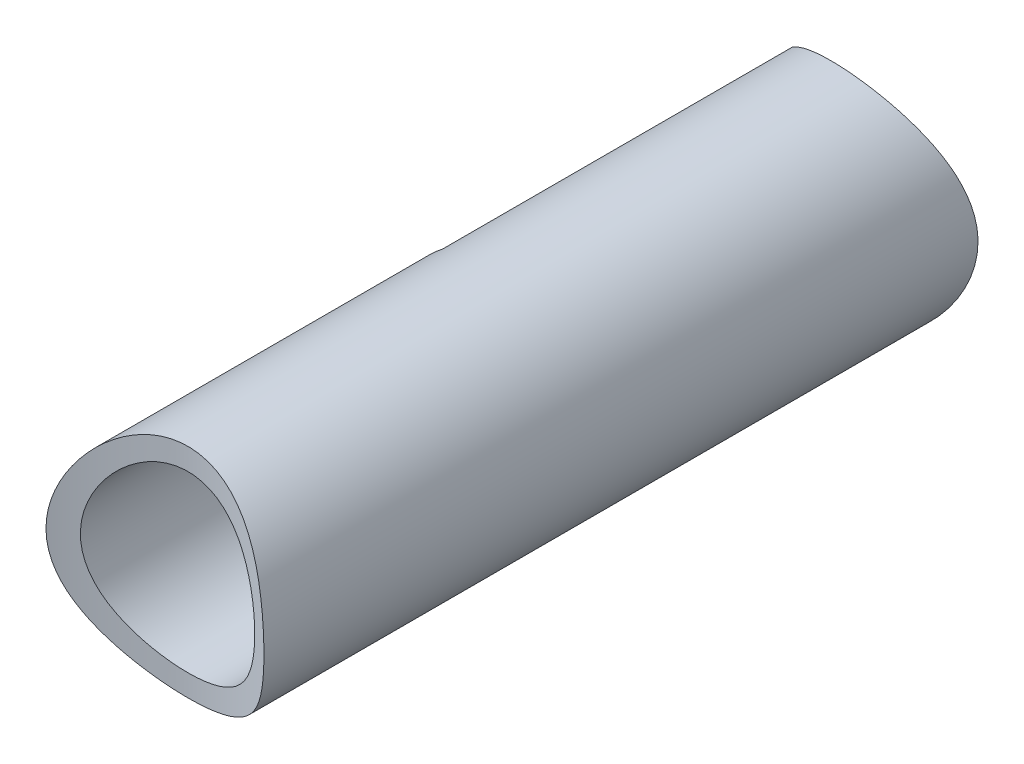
ISO-10303-21;
HEADER;
FILE_DESCRIPTION(('STEP AP214'),'2;1');
FILE_NAME('part.step','',(''),(''),'','','');
FILE_SCHEMA(('AUTOMOTIVE_DESIGN { 1 0 10303 214 1 1 1 1 }'));
ENDSEC;
DATA;
#1=APPLICATION_CONTEXT('core data for automotive mechanical design processes');
#2=APPLICATION_PROTOCOL_DEFINITION('international standard','automotive_design',2000,#1);
#3=PRODUCT_CONTEXT('',#1,'mechanical');
#4=PRODUCT('Part','Part','',(#3));
#5=PRODUCT_RELATED_PRODUCT_CATEGORY('part','',(#4));
#6=PRODUCT_DEFINITION_FORMATION('','',#4);
#7=PRODUCT_DEFINITION_CONTEXT('part definition',#1,'design');
#8=PRODUCT_DEFINITION('design','',#6,#7);
#9=PRODUCT_DEFINITION_SHAPE('','',#8);
#10=(LENGTH_UNIT() NAMED_UNIT(*) SI_UNIT(.MILLI.,.METRE.));
#11=(NAMED_UNIT(*) PLANE_ANGLE_UNIT() SI_UNIT($,.RADIAN.));
#12=(NAMED_UNIT(*) SI_UNIT($,.STERADIAN.) SOLID_ANGLE_UNIT());
#13=UNCERTAINTY_MEASURE_WITH_UNIT(LENGTH_MEASURE(1.E-05),#10,'distance_accuracy_value','');
#14=(GEOMETRIC_REPRESENTATION_CONTEXT(3) GLOBAL_UNCERTAINTY_ASSIGNED_CONTEXT((#13)) GLOBAL_UNIT_ASSIGNED_CONTEXT((#10,
#11,#12)) REPRESENTATION_CONTEXT('',''));
#15=CARTESIAN_POINT('',(0.,0.,0.));
#16=DIRECTION('',(0.,0.,1.));
#17=DIRECTION('',(1.,0.,0.));
#18=AXIS2_PLACEMENT_3D('',#15,#16,#17);
#19=CARTESIAN_POINT('',(0.,0.,-152.5524));
#20=DIRECTION('',(0.,0.,1.));
#21=DIRECTION('',(1.,0.,0.));
#22=AXIS2_PLACEMENT_3D('',#19,#20,#21);
#23=CYLINDRICAL_SURFACE('',#22,15.875);
#24=CARTESIAN_POINT('',(15.875,0.,-127.80572408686));
#25=CARTESIAN_POINT('',(15.874998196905,-0.415255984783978,-127.805721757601));
#26=CARTESIAN_POINT('',(15.8586851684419,-0.830540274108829,-127.796282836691));
#27=CARTESIAN_POINT('',(15.7936603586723,-1.65773676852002,-127.758912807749));
#28=CARTESIAN_POINT('',(15.7449454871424,-2.06964864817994,-127.730979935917));
#29=CARTESIAN_POINT('',(15.6157344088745,-2.88719072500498,-127.657726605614));
#30=CARTESIAN_POINT('',(15.5352140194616,-3.29281589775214,-127.612392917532));
#31=CARTESIAN_POINT('',(15.3433976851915,-4.0945949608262,-127.506084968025));
#32=CARTESIAN_POINT('',(15.232101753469,-4.49074885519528,-127.445110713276));
#33=CARTESIAN_POINT('',(14.9806135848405,-5.26908394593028,-127.310067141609));
#34=CARTESIAN_POINT('',(14.8405762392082,-5.65132761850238,-127.236068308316));
#35=CARTESIAN_POINT('',(14.5324767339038,-6.40214736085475,-127.077152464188));
#36=CARTESIAN_POINT('',(14.3644037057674,-6.77071806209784,-126.992231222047));
#37=CARTESIAN_POINT('',(14.0015382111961,-7.492375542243,-126.814041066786));
#38=CARTESIAN_POINT('',(13.8067435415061,-7.84546104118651,-126.720771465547));
#39=CARTESIAN_POINT('',(13.3916952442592,-8.53463137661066,-126.528489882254));
#40=CARTESIAN_POINT('',(13.1714434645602,-8.87071744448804,-126.429478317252));
#41=CARTESIAN_POINT('',(12.686986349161,-9.55223708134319,-126.219769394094));
#42=CARTESIAN_POINT('',(12.4206400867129,-9.89606426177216,-126.108791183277));
#43=CARTESIAN_POINT('',(11.8607545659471,-10.5606308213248,-125.886286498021));
#44=CARTESIAN_POINT('',(11.5672143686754,-10.881369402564,-125.774760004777));
#45=CARTESIAN_POINT('',(10.9541400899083,-11.4983333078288,-125.554199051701));
#46=CARTESIAN_POINT('',(10.6345899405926,-11.7945432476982,-125.445166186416));
#47=CARTESIAN_POINT('',(9.97125544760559,-12.3604072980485,-125.23272751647));
#48=CARTESIAN_POINT('',(9.62748061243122,-12.6300717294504,-125.129319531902));
#49=CARTESIAN_POINT('',(8.89780678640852,-13.1551332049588,-124.925579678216));
#50=CARTESIAN_POINT('',(8.51063276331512,-13.4089482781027,-124.825723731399));
#51=CARTESIAN_POINT('',(7.7132472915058,-13.8829592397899,-124.638720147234));
#52=CARTESIAN_POINT('',(7.30303466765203,-14.1031534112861,-124.551573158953));
#53=CARTESIAN_POINT('',(6.46260494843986,-14.5075031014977,-124.393091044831));
#54=CARTESIAN_POINT('',(6.03240174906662,-14.6916832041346,-124.32174512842));
#55=CARTESIAN_POINT('',(5.15505903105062,-15.0220042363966,-124.197518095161));
#56=CARTESIAN_POINT('',(4.70792171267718,-15.1681500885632,-124.144634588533));
#57=CARTESIAN_POINT('',(3.84128623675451,-15.4092160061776,-124.063398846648));
#58=CARTESIAN_POINT('',(3.42290270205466,-15.5075532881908,-124.033272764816));
#59=CARTESIAN_POINT('',(2.57864039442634,-15.6700665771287,-123.991468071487));
#60=CARTESIAN_POINT('',(2.15276207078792,-15.7342446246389,-123.979788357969));
#61=CARTESIAN_POINT('',(1.29729891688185,-15.8277511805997,-123.975673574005));
#62=CARTESIAN_POINT('',(0.867715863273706,-15.8570955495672,-123.983229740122));
#63=CARTESIAN_POINT('',(0.00838102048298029,-15.880814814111,-124.017826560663));
#64=CARTESIAN_POINT('',(-0.421370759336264,-15.875191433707,-124.04486625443));
#65=CARTESIAN_POINT('',(-1.24067920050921,-15.831297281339,-124.114988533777));
#66=CARTESIAN_POINT('',(-1.6305271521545,-15.7958627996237,-124.156499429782));
#67=CARTESIAN_POINT('',(-2.40459854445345,-15.6966801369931,-124.254944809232));
#68=CARTESIAN_POINT('',(-2.78882238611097,-15.6329339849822,-124.311878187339));
#69=CARTESIAN_POINT('',(-3.54924668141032,-15.4780187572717,-124.440246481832));
#70=CARTESIAN_POINT('',(-3.92544644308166,-15.386847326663,-124.511682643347));
#71=CARTESIAN_POINT('',(-4.66764015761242,-15.1781876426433,-124.667857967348));
#72=CARTESIAN_POINT('',(-5.0336336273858,-15.0606981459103,-124.752597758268));
#73=CARTESIAN_POINT('',(-5.76619060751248,-14.7960678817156,-124.937159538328));
#74=CARTESIAN_POINT('',(-6.13232257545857,-14.6480305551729,-125.037406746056));
#75=CARTESIAN_POINT('',(-6.84991151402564,-14.3265116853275,-125.248908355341));
#76=CARTESIAN_POINT('',(-7.20136831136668,-14.1530298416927,-125.360162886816));
#77=CARTESIAN_POINT('',(-7.88825856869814,-13.7819958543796,-125.591835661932));
#78=CARTESIAN_POINT('',(-8.22368887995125,-13.5844390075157,-125.712255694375));
#79=CARTESIAN_POINT('',(-8.87730969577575,-13.1666048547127,-125.960284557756));
#80=CARTESIAN_POINT('',(-9.19549849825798,-12.9463253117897,-126.087894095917));
#81=CARTESIAN_POINT('',(-9.85240384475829,-12.4552938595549,-126.364585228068));
#82=CARTESIAN_POINT('',(-10.1886928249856,-12.1816764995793,-126.514353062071));
#83=CARTESIAN_POINT('',(-10.8369526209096,-11.6087571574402,-126.817372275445));
#84=CARTESIAN_POINT('',(-11.1489215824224,-11.3094532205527,-126.970623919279));
#85=CARTESIAN_POINT('',(-11.747798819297,-10.6860621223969,-127.277633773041));
#86=CARTESIAN_POINT('',(-12.0346712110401,-10.3619406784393,-127.431392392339));
#87=CARTESIAN_POINT('',(-12.5816559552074,-9.69046408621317,-127.735800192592));
#88=CARTESIAN_POINT('',(-12.8417673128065,-9.34310807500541,-127.886449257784));
#89=CARTESIAN_POINT('',(-13.3566002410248,-8.59315814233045,-128.194596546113));
#90=CARTESIAN_POINT('',(-13.6086083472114,-8.18842499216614,-128.351443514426));
#91=CARTESIAN_POINT('',(-14.0770196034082,-7.35404923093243,-128.651962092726));
#92=CARTESIAN_POINT('',(-14.2934170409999,-6.92440263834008,-128.795631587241));
#93=CARTESIAN_POINT('',(-14.6876731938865,-6.04320739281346,-129.063974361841));
#94=CARTESIAN_POINT('',(-14.8656134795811,-5.59170763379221,-129.188687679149));
#95=CARTESIAN_POINT('',(-15.1807220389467,-4.66890746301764,-129.413796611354));
#96=CARTESIAN_POINT('',(-15.3179098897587,-4.19761668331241,-129.514203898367));
#97=CARTESIAN_POINT('',(-15.5167953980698,-3.37219349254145,-129.661693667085));
#98=CARTESIAN_POINT('',(-15.5888774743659,-3.02179103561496,-129.715842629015));
#99=CARTESIAN_POINT('',(-15.7094248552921,-2.31475947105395,-129.807009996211));
#100=CARTESIAN_POINT('',(-15.7578944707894,-1.95813151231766,-129.844031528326));
#101=CARTESIAN_POINT('',(-15.830495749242,-1.24125958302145,-129.899670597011));
#102=CARTESIAN_POINT('',(-15.8546467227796,-0.881018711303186,-129.918302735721));
#103=CARTESIAN_POINT('',(-15.8783075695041,-0.159227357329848,-129.936555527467));
#104=CARTESIAN_POINT('',(-15.8778166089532,0.202323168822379,-129.936175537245));
#105=CARTESIAN_POINT('',(-15.8521975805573,0.924042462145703,-129.916414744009));
#106=CARTESIAN_POINT('',(-15.8270680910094,1.28421114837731,-129.897032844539));
#107=CARTESIAN_POINT('',(-15.7525592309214,2.0005473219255,-129.83995500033));
#108=CARTESIAN_POINT('',(-15.7031797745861,2.35671479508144,-129.802258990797));
#109=CARTESIAN_POINT('',(-15.5808367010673,3.06295431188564,-129.709792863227));
#110=CARTESIAN_POINT('',(-15.5078569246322,3.4130220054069,-129.655011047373));
#111=CARTESIAN_POINT('',(-15.3392543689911,4.10483838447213,-129.53009336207));
#112=CARTESIAN_POINT('',(-15.2436307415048,4.44658675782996,-129.459956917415));
#113=CARTESIAN_POINT('',(-15.028070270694,5.12873030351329,-129.304356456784));
#114=CARTESIAN_POINT('',(-14.9075785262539,5.46887154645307,-129.218548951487));
#115=CARTESIAN_POINT('',(-14.6450036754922,6.13747953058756,-129.035126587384));
#116=CARTESIAN_POINT('',(-14.50291183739,6.46594148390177,-128.937506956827));
#117=CARTESIAN_POINT('',(-14.0458141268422,7.43223027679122,-128.630349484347));
#118=CARTESIAN_POINT('',(-13.6998802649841,8.05129060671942,-128.406433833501));
#119=CARTESIAN_POINT('',(-13.0882509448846,8.99389578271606,-128.032509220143));
#120=CARTESIAN_POINT('',(-12.8463613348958,9.33603423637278,-127.889059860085));
#121=CARTESIAN_POINT('',(-12.337186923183,9.99920295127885,-127.598049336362));
#122=CARTESIAN_POINT('',(-12.0698996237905,10.3202311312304,-127.450487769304));
#123=CARTESIAN_POINT('',(-11.5108943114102,10.9402641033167,-127.1543123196));
#124=CARTESIAN_POINT('',(-11.219155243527,11.239249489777,-127.005697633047));
#125=CARTESIAN_POINT('',(-10.6124736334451,11.8137867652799,-126.710475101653));
#126=CARTESIAN_POINT('',(-10.2975299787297,12.0893375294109,-126.563867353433));
#127=CARTESIAN_POINT('',(-9.60380256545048,12.6493432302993,-126.257020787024));
#128=CARTESIAN_POINT('',(-9.22200391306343,12.930435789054,-126.097434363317));
#129=CARTESIAN_POINT('',(-8.43191245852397,13.458988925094,-125.788207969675));
#130=CARTESIAN_POINT('',(-8.02361698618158,13.7064461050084,-125.638569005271));
#131=CARTESIAN_POINT('',(-7.18283593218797,14.1651575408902,-125.352973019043));
#132=CARTESIAN_POINT('',(-6.75036162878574,14.3764284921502,-125.217009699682));
#133=CARTESIAN_POINT('',(-5.86374099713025,14.7602651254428,-124.96214293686));
#134=CARTESIAN_POINT('',(-5.4095975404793,14.9328359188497,-124.843237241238));
#135=CARTESIAN_POINT('',(-4.51606611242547,15.2258263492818,-124.633366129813));
#136=CARTESIAN_POINT('',(-4.07793681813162,15.3490881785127,-124.541012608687));
#137=CARTESIAN_POINT('',(-3.18917608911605,15.5580561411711,-124.375845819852));
#138=CARTESIAN_POINT('',(-2.73854510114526,15.6437636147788,-124.303031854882));
#139=CARTESIAN_POINT('',(-1.82907027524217,15.7759656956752,-124.178677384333));
#140=CARTESIAN_POINT('',(-1.37023411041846,15.8224951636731,-124.127117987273));
#141=CARTESIAN_POINT('',(-0.448319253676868,15.8753811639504,-124.046259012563));
#142=CARTESIAN_POINT('',(0.0147588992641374,15.8817427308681,-124.016956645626));
#143=CARTESIAN_POINT('',(0.88077431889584,15.8556810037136,-123.983289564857));
#144=CARTESIAN_POINT('',(1.2837628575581,15.8281556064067,-123.976195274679));
#145=CARTESIAN_POINT('',(2.0863810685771,15.742473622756,-123.978937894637));
#146=CARTESIAN_POINT('',(2.48601108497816,15.6843202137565,-123.988773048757));
#147=CARTESIAN_POINT('',(3.27893850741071,15.5379131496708,-124.024743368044));
#148=CARTESIAN_POINT('',(3.67223616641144,15.4496607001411,-124.050877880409));
#149=CARTESIAN_POINT('',(4.44975974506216,15.2439165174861,-124.118434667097));
#150=CARTESIAN_POINT('',(4.83398543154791,15.1264240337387,-124.159857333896));
#151=CARTESIAN_POINT('',(5.58351125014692,14.8658803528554,-124.255712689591));
#152=CARTESIAN_POINT('',(5.94903389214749,14.723368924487,-124.309877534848));
#153=CARTESIAN_POINT('',(6.6668770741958,14.4125417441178,-124.430113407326));
#154=CARTESIAN_POINT('',(7.01919795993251,14.2442266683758,-124.496184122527));
#155=CARTESIAN_POINT('',(7.70892322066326,13.8830722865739,-124.638553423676));
#156=CARTESIAN_POINT('',(8.04632562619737,13.6902297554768,-124.714853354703));
#157=CARTESIAN_POINT('',(8.70468591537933,13.2813499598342,-124.875854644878));
#158=CARTESIAN_POINT('',(9.02564215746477,13.0653103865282,-124.960556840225));
#159=CARTESIAN_POINT('',(9.67831470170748,12.5906000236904,-125.14447158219));
#160=CARTESIAN_POINT('',(10.0083366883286,12.3298377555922,-125.244302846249));
#161=CARTESIAN_POINT('',(10.6457810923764,11.7838496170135,-125.449074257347));
#162=CARTESIAN_POINT('',(10.9532023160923,11.4986224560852,-125.554014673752));
#163=CARTESIAN_POINT('',(11.5443938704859,10.9049635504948,-125.766403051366));
#164=CARTESIAN_POINT('',(11.8281431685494,10.596511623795,-125.873853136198));
#165=CARTESIAN_POINT('',(12.3704408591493,9.95807499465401,-126.088389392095));
#166=CARTESIAN_POINT('',(12.6289885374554,9.62808968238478,-126.195475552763));
#167=CARTESIAN_POINT('',(13.1423537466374,8.91650308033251,-126.416197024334));
#168=CARTESIAN_POINT('',(13.3946098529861,8.53295151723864,-126.529520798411));
#169=CARTESIAN_POINT('',(13.8656886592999,7.7439838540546,-126.748443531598));
#170=CARTESIAN_POINT('',(14.0845271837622,7.33857822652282,-126.854046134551));
#171=CARTESIAN_POINT('',(14.4869136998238,6.50827217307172,-127.053651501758));
#172=CARTESIAN_POINT('',(14.6704903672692,6.08338793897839,-127.147663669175));
#173=CARTESIAN_POINT('',(15.0006189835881,5.216513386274,-127.320403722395));
#174=CARTESIAN_POINT('',(15.1471810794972,4.77452779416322,-127.399135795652));
#175=CARTESIAN_POINT('',(15.3731251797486,3.97671011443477,-127.522422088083));
#176=CARTESIAN_POINT('',(15.4601993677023,3.62361011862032,-127.570682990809));
#177=CARTESIAN_POINT('',(15.6100996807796,2.91083837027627,-127.654514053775));
#178=CARTESIAN_POINT('',(15.6729296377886,2.5511676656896,-127.690086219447));
#179=CARTESIAN_POINT('',(15.7736976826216,1.82743144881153,-127.747444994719));
#180=CARTESIAN_POINT('',(15.8116475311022,1.46336809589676,-127.769238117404));
#181=CARTESIAN_POINT('',(15.8623008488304,0.732877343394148,-127.798379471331));
#182=CARTESIAN_POINT('',(15.8750015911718,0.366449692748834,-127.805726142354));
#183=CARTESIAN_POINT('',(15.875,0.,-127.80572408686));
#184=B_SPLINE_CURVE_WITH_KNOTS('',3,(#24,#25,#26,#27,#28,#29,#30,#31,#32,#33,#34,#35,#36,#37,
#38,#39,#40,#41,#42,#43,#44,#45,#46,#47,#48,#49,#50,#51,#52,#53,#54,#55,#56,#57,#58,#59,#60,#61,
#62,#63,#64,#65,#66,#67,#68,#69,#70,#71,#72,#73,#74,#75,#76,#77,#78,#79,#80,#81,#82,#83,#84,#85,
#86,#87,#88,#89,#90,#91,#92,#93,#94,#95,#96,#97,#98,#99,#100,#101,#102,#103,#104,#105,#106,#107,
#108,#109,#110,#111,#112,#113,#114,#115,#116,#117,#118,#119,#120,#121,#122,#123,#124,#125,#126,
#127,#128,#129,#130,#131,#132,#133,#134,#135,#136,#137,#138,#139,#140,#141,#142,#143,#144,#145,
#146,#147,#148,#149,#150,#151,#152,#153,#154,#155,#156,#157,#158,#159,#160,#161,#162,#163,#164,
#165,#166,#167,#168,#169,#170,#171,#172,#173,#174,#175,#176,#177,#178,#179,#180,#181,#182,#183),
.UNSPECIFIED.,.T.,.F.,(4,2,2,2,2,2,2,2,2,2,2,2,2,2,2,2,2,2,2,2,2,2,2,2,2,2,2,2,2,2,2,2,2,2,2,2,
2,2,2,2,2,2,2,2,2,2,2,2,2,2,2,2,2,2,2,2,2,2,2,2,2,2,2,2,2,2,2,2,2,2,2,2,2,2,2,2,2,2,2,4),(0.,
1.2453941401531,2.49090707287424,3.73736883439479,4.98383006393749,6.22374247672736,
7.46413668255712,8.70463322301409,9.94503977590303,11.2901695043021,12.635345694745,
13.9813592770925,15.3268474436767,16.7457702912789,18.1647655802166,19.5827888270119,
21.0006284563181,22.2913917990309,23.5820780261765,24.8721763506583,26.1622110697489,
27.3418008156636,28.5213060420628,29.7009125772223,30.8805748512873,32.1016734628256,
33.3227864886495,34.544138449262,35.7656107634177,37.1402180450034,38.5149300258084,
39.8915765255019,41.2682741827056,42.7720416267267,44.2760500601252,45.7768363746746,
47.2769005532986,48.3612266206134,49.445354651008,50.5286211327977,51.6119242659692,
52.6952899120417,53.7786593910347,54.8627722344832,55.9469256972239,57.0585630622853,
58.1706510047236,60.393768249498,61.7214266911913,63.0492158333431,64.3781602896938,
65.7071685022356,67.2060197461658,68.7050222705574,70.2033313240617,71.7014423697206,
73.0926776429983,74.4838632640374,75.8738096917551,77.2635819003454,78.4740543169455,
79.6844011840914,80.8946995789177,82.1050290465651,83.2918897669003,84.4787193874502,
85.665705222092,86.8528093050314,88.1483286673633,89.4439164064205,90.7406432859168,
92.0374069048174,93.4542264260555,94.8703729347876,96.285362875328,97.6999644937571,
98.799558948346,99.8989795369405,100.997880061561,102.096899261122),.UNSPECIFIED.);
#185=CARTESIAN_POINT('',(-9.525,12.7,-126.226690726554));
#186=VERTEX_POINT('',#185);
#187=CARTESIAN_POINT('',(-9.525,-12.7,-126.226690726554));
#188=VERTEX_POINT('',#187);
#189=EDGE_CURVE('E53',#186,#188,#184,.T.);
#190=ORIENTED_EDGE('',*,*,#189,.F.);
#191=DIRECTION('',(0.,0.,1.));
#192=VECTOR('',#191,1.);
#193=CARTESIAN_POINT('',(-9.525,12.7,-152.5524));
#194=LINE('',#193,#192);
#195=CARTESIAN_POINT('',(-9.525,12.7,-75.1978657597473));
#196=VERTEX_POINT('',#195);
#197=EDGE_CURVE('E94',#196,#186,#194,.F.);
#198=ORIENTED_EDGE('',*,*,#197,.F.);
#199=CARTESIAN_POINT('',(-9.52500000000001,-12.7,-76.2496255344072));
#200=CARTESIAN_POINT('',(-9.88462352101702,-12.4303297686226,-76.1934045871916));
#201=CARTESIAN_POINT('',(-10.2325667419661,-12.1454628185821,-76.1355155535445));
#202=CARTESIAN_POINT('',(-10.902883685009,-11.5474735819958,-76.0178251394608));
#203=CARTESIAN_POINT('',(-11.2252586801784,-11.2343527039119,-75.9580238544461));
#204=CARTESIAN_POINT('',(-11.8422686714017,-10.58196416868,-75.8379264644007));
#205=CARTESIAN_POINT('',(-12.1369034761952,-10.2426963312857,-75.7776303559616));
#206=CARTESIAN_POINT('',(-12.6964370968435,-9.54031900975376,-75.6579469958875));
#207=CARTESIAN_POINT('',(-12.9613360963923,-9.17720967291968,-75.5985597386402));
#208=CARTESIAN_POINT('',(-13.4596861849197,-8.4293823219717,-75.4820129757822));
#209=CARTESIAN_POINT('',(-13.6931200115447,-8.04465260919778,-75.4248547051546));
#210=CARTESIAN_POINT('',(-14.126675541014,-7.25637596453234,-75.3140743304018));
#211=CARTESIAN_POINT('',(-14.3267977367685,-6.85282931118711,-75.2604521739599));
#212=CARTESIAN_POINT('',(-14.6921481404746,-6.02984433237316,-75.157926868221));
#213=CARTESIAN_POINT('',(-14.857389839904,-5.6104122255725,-75.109021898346));
#214=CARTESIAN_POINT('',(-15.1517618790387,-4.75845044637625,-75.0169329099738));
#215=CARTESIAN_POINT('',(-15.280892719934,-4.32592095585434,-74.9737488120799));
#216=CARTESIAN_POINT('',(-15.5009681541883,-3.45479607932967,-74.8943194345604));
#217=CARTESIAN_POINT('',(-15.5922455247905,-3.01629015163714,-74.8580152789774));
#218=CARTESIAN_POINT('',(-15.7374738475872,-2.13261109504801,-74.7925216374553));
#219=CARTESIAN_POINT('',(-15.7914249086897,-1.68743798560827,-74.7633321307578));
#220=CARTESIAN_POINT('',(-15.861483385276,-0.793669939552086,-74.7125159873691));
#221=CARTESIAN_POINT('',(-15.8775889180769,-0.345074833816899,-74.6908897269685));
#222=CARTESIAN_POINT('',(-15.8717356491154,0.552172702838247,-74.6554342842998));
#223=CARTESIAN_POINT('',(-15.8497774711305,1.00082513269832,-74.6416049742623));
#224=CARTESIAN_POINT('',(-15.7687562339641,1.88550702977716,-74.6219564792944));
#225=CARTESIAN_POINT('',(-15.7104755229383,2.32160477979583,-74.6159764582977));
#226=CARTESIAN_POINT('',(-15.5579163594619,3.1874939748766,-74.6112961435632));
#227=CARTESIAN_POINT('',(-15.4636382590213,3.61728548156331,-74.6125957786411));
#228=CARTESIAN_POINT('',(-15.2397555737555,4.46752169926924,-74.6220768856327));
#229=CARTESIAN_POINT('',(-15.1101482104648,4.88796567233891,-74.6302588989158));
#230=CARTESIAN_POINT('',(-14.816562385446,5.71649060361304,-74.6529245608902));
#231=CARTESIAN_POINT('',(-14.6525844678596,6.12457175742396,-74.667408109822));
#232=CARTESIAN_POINT('',(-14.2917330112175,6.92491045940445,-74.7019077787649));
#233=CARTESIAN_POINT('',(-14.0949108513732,7.31719155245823,-74.7219152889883));
#234=CARTESIAN_POINT('',(-13.6696044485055,8.08391847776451,-74.7665975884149));
#235=CARTESIAN_POINT('',(-13.4411198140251,8.45836408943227,-74.7912724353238));
#236=CARTESIAN_POINT('',(-12.9542399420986,9.1866772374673,-74.8442900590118));
#237=CARTESIAN_POINT('',(-12.6958627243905,9.54055697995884,-74.8726306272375));
#238=CARTESIAN_POINT('',(-12.1509767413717,10.2255015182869,-74.9319178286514));
#239=CARTESIAN_POINT('',(-11.8644770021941,10.5565735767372,-74.9628636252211));
#240=CARTESIAN_POINT('',(-11.2515851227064,11.2083191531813,-75.0276989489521));
#241=CARTESIAN_POINT('',(-10.9239747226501,11.5278449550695,-75.0616583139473));
#242=CARTESIAN_POINT('',(-10.4132420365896,11.9846619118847,-75.112818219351));
#243=CARTESIAN_POINT('',(-10.2399317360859,12.1330738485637,-75.1298939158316));
#244=CARTESIAN_POINT('',(-9.88707486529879,12.4222943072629,-75.1639728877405));
#245=CARTESIAN_POINT('',(-9.70752835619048,12.5631029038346,-75.1809761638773));
#246=CARTESIAN_POINT('',(-9.52500000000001,12.7,-75.1978657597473));
#247=B_SPLINE_CURVE_WITH_KNOTS('',3,(#199,#200,#201,#202,#203,#204,#205,#206,#207,#208,#209,
#210,#211,#212,#213,#214,#215,#216,#217,#218,#219,#220,#221,#222,#223,#224,#225,#226,#227,#228,
#229,#230,#231,#232,#233,#234,#235,#236,#237,#238,#239,#240,#241,#242,#243,#244,#245,#246),
.UNSPECIFIED.,.F.,.F.,(4,2,2,2,2,2,2,2,2,2,2,2,2,2,2,2,2,2,2,2,2,2,2,4),(0.,1.35857886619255,
2.71709004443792,4.07561058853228,5.43412273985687,6.79337718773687,8.1526115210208,
9.51131914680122,10.8700079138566,12.2164851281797,13.5629584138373,14.9094986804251,
16.2560168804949,17.574489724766,18.8929496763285,20.2115133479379,21.530056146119,
22.8465553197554,24.1630707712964,25.4787967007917,26.7941017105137,28.1689011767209,
28.855150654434,29.5413934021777),.UNSPECIFIED.);
#248=CARTESIAN_POINT('',(-9.525,-12.7,-76.2496255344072));
#249=VERTEX_POINT('',#248);
#250=EDGE_CURVE('E91',#249,#196,#247,.T.);
#251=ORIENTED_EDGE('',*,*,#250,.F.);
#252=DIRECTION('',(0.,0.,1.));
#253=VECTOR('',#252,1.);
#254=CARTESIAN_POINT('',(-9.525,-12.7,-152.5524));
#255=LINE('',#254,#253);
#256=EDGE_CURVE('E135',#188,#249,#255,.T.);
#257=ORIENTED_EDGE('',*,*,#256,.F.);
#258=EDGE_LOOP('',(#190,#198,#251,#257));
#259=FACE_BOUND('',#258,.T.);
#260=CARTESIAN_POINT('',(15.875,0.,-23.7595244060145));
#261=CARTESIAN_POINT('',(15.8750055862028,0.406171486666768,-23.759516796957));
#262=CARTESIAN_POINT('',(15.8593942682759,0.812284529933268,-23.7699726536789));
#263=CARTESIAN_POINT('',(15.7972091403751,1.6212233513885,-23.8113467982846));
#264=CARTESIAN_POINT('',(15.7506257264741,2.02404807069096,-23.8422714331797));
#265=CARTESIAN_POINT('',(15.6271188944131,2.82359496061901,-23.9234028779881));
#266=CARTESIAN_POINT('',(15.5501529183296,3.22030775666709,-23.9736367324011));
#267=CARTESIAN_POINT('',(15.3669709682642,4.00423033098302,-24.0914644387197));
#268=CARTESIAN_POINT('',(15.2607563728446,4.39144055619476,-24.1590574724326));
#269=CARTESIAN_POINT('',(15.021158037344,5.15152367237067,-24.3087479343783));
#270=CARTESIAN_POINT('',(14.8879585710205,5.52447442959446,-24.3907465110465));
#271=CARTESIAN_POINT('',(14.5952324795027,6.25703419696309,-24.5670306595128));
#272=CARTESIAN_POINT('',(14.4356955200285,6.61663790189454,-24.6613210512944));
#273=CARTESIAN_POINT('',(14.0916309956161,7.32087055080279,-24.8595244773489));
#274=CARTESIAN_POINT('',(13.9071047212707,7.66550026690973,-24.963437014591));
#275=CARTESIAN_POINT('',(13.5142741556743,8.33857672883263,-25.1782669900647));
#276=CARTESIAN_POINT('',(13.3059714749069,8.66702456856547,-25.2891839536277));
#277=CARTESIAN_POINT('',(12.8439375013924,9.33981771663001,-25.5272052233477));
#278=CARTESIAN_POINT('',(12.5877360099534,9.6822960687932,-25.6547975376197));
#279=CARTESIAN_POINT('',(12.0490134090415,10.3450122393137,-25.912179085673));
#280=CARTESIAN_POINT('',(11.7664907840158,10.6652487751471,-26.0419684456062));
#281=CARTESIAN_POINT('',(11.1761441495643,11.2823707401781,-26.3007292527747));
#282=CARTESIAN_POINT('',(10.8683008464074,11.5792380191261,-26.4296999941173));
#283=CARTESIAN_POINT('',(10.2288693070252,12.1477911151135,-26.683687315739));
#284=CARTESIAN_POINT('',(9.89728949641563,12.419485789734,-26.8087052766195));
#285=CARTESIAN_POINT('',(9.18123090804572,12.9591272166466,-27.0627490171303));
#286=CARTESIAN_POINT('',(8.79466779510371,13.2246124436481,-27.191149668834));
#287=CARTESIAN_POINT('',(7.9968353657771,13.7217773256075,-27.4363884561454));
#288=CARTESIAN_POINT('',(7.58556420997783,13.953454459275,-27.5532257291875));
#289=CARTESIAN_POINT('',(6.74103887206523,14.3804641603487,-27.7719127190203));
#290=CARTESIAN_POINT('',(6.30779790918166,14.5758182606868,-27.8737713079));
#291=CARTESIAN_POINT('',(5.42218500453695,14.9279103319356,-28.0594925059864));
#292=CARTESIAN_POINT('',(4.96981568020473,15.0846535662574,-28.1433575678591));
#293=CARTESIAN_POINT('',(4.08855640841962,15.345759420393,-28.2842060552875));
#294=CARTESIAN_POINT('',(3.66091265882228,15.4534291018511,-28.3428622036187));
#295=CARTESIAN_POINT('',(2.7960333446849,15.6330687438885,-28.4412055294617));
#296=CARTESIAN_POINT('',(2.35879827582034,15.7050405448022,-28.4808936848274));
#297=CARTESIAN_POINT('',(1.47877265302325,15.812185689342,-28.5401160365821));
#298=CARTESIAN_POINT('',(1.03598590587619,15.8473829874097,-28.559663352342));
#299=CARTESIAN_POINT('',(0.14860501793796,15.8805108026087,-28.5780583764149));
#300=CARTESIAN_POINT('',(-0.295988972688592,15.8784443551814,-28.5769077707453));
#301=CARTESIAN_POINT('',(-1.1354244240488,15.8393076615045,-28.5551828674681));
#302=CARTESIAN_POINT('',(-1.53050263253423,15.8060038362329,-28.5366986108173));
#303=CARTESIAN_POINT('',(-2.31597347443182,15.7101368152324,-28.4837110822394));
#304=CARTESIAN_POINT('',(-2.7063665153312,15.6475761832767,-28.4492092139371));
#305=CARTESIAN_POINT('',(-3.47982325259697,15.4939323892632,-28.3649928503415));
#306=CARTESIAN_POINT('',(-3.86288668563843,15.4028482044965,-28.315277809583));
#307=CARTESIAN_POINT('',(-4.61926296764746,15.1931586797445,-28.2017606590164));
#308=CARTESIAN_POINT('',(-4.99257543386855,15.0745522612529,-28.1379579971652));
#309=CARTESIAN_POINT('',(-5.73106148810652,14.8096597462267,-27.9969342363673));
#310=CARTESIAN_POINT('',(-6.09611290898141,14.6631031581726,-27.9195826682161));
#311=CARTESIAN_POINT('',(-6.81219262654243,14.3444501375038,-27.7535540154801));
#312=CARTESIAN_POINT('',(-7.1632209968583,14.172353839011,-27.6648769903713));
#313=CARTESIAN_POINT('',(-7.84974443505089,13.8039462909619,-27.4779681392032));
#314=CARTESIAN_POINT('',(-8.1852366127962,13.6076305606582,-27.3797345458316));
#315=CARTESIAN_POINT('',(-8.83931789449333,13.1921277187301,-27.17562306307));
#316=CARTESIAN_POINT('',(-9.15790540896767,12.9729384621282,-27.069744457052));
#317=CARTESIAN_POINT('',(-9.81086958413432,12.4878126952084,-26.8404526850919));
#318=CARTESIAN_POINT('',(-10.1431688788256,12.2193851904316,-26.7163875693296));
#319=CARTESIAN_POINT('',(-10.7842238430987,11.6575227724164,-26.4641232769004));
#320=CARTESIAN_POINT('',(-11.0929780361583,11.3640862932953,-26.335923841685));
#321=CARTESIAN_POINT('',(-11.6859976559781,10.7533449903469,-26.0782037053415));
#322=CARTESIAN_POINT('',(-11.9702383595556,10.4360166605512,-25.9486818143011));
#323=CARTESIAN_POINT('',(-12.5126586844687,9.77908295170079,-25.6915181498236));
#324=CARTESIAN_POINT('',(-12.7708370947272,9.4394765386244,-25.563876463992));
#325=CARTESIAN_POINT('',(-13.2820615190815,8.7074371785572,-25.3023165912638));
#326=CARTESIAN_POINT('',(-13.5325074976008,8.31300844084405,-25.1688826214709));
#327=CARTESIAN_POINT('',(-13.9989441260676,7.50096232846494,-24.9124679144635));
#328=CARTESIAN_POINT('',(-14.2149318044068,7.08334295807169,-24.7894880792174));
#329=CARTESIAN_POINT('',(-14.6101349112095,6.22748079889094,-24.5586428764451));
#330=CARTESIAN_POINT('',(-14.7893840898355,5.78925739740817,-24.4507636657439));
#331=CARTESIAN_POINT('',(-15.1090596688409,4.8946351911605,-24.2545292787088));
#332=CARTESIAN_POINT('',(-15.249492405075,4.43823936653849,-24.166170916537));
#333=CARTESIAN_POINT('',(-15.479672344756,3.54814988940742,-24.0193150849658));
#334=CARTESIAN_POINT('',(-15.5725851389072,3.11557805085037,-23.9589889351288));
#335=CARTESIAN_POINT('',(-15.7221845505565,2.24164978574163,-23.8610893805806));
#336=CARTESIAN_POINT('',(-15.7788735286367,1.80029393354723,-23.8235144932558));
#337=CARTESIAN_POINT('',(-15.8549411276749,0.913425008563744,-23.7729588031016));
#338=CARTESIAN_POINT('',(-15.8743582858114,0.467916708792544,-23.759952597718));
#339=CARTESIAN_POINT('',(-15.8756101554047,-0.423150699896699,-23.7591173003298));
#340=CARTESIAN_POINT('',(-15.8574491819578,-0.868709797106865,-23.7712853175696));
#341=CARTESIAN_POINT('',(-15.7894489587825,-1.68877975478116,-23.8164906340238));
#342=CARTESIAN_POINT('',(-15.7447699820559,-2.06392292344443,-23.8461238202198));
#343=CARTESIAN_POINT('',(-15.6291551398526,-2.8083786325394,-23.9220593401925));
#344=CARTESIAN_POINT('',(-15.5582224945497,-3.17769188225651,-23.9683596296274));
#345=CARTESIAN_POINT('',(-15.3909325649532,-3.90837198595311,-24.0761228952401));
#346=CARTESIAN_POINT('',(-15.2945658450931,-4.26973583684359,-24.1375914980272));
#347=CARTESIAN_POINT('',(-15.077441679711,-4.98248870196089,-24.2738085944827));
#348=CARTESIAN_POINT('',(-14.9566825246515,-5.33387701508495,-24.3485580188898));
#349=CARTESIAN_POINT('',(-14.6864406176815,-6.03924835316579,-24.5125491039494));
#350=CARTESIAN_POINT('',(-14.5359844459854,-6.39274881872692,-24.60225873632));
#351=CARTESIAN_POINT('',(-14.2109713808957,-7.08593920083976,-24.7914152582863));
#352=CARTESIAN_POINT('',(-14.0364045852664,-7.42562336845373,-24.89086614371));
#353=CARTESIAN_POINT('',(-13.6643215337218,-8.08992600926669,-25.0970551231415));
#354=CARTESIAN_POINT('',(-13.4668017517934,-8.4145421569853,-25.2037943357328));
#355=CARTESIAN_POINT('',(-13.0498633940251,-9.04767332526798,-25.4221769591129));
#356=CARTESIAN_POINT('',(-12.8304428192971,-9.35618687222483,-25.5338208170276));
#357=CARTESIAN_POINT('',(-12.3332951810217,-10.0049224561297,-25.7780736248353));
#358=CARTESIAN_POINT('',(-12.0518860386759,-10.3421575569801,-25.9111428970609));
#359=CARTESIAN_POINT('',(-11.4621236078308,-10.9921774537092,-26.1773764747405));
#360=CARTESIAN_POINT('',(-11.1537678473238,-11.3049600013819,-26.3105407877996));
#361=CARTESIAN_POINT('',(-10.5112531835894,-11.9047225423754,-26.5737608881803));
#362=CARTESIAN_POINT('',(-10.1770779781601,-12.1916859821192,-26.7038146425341));
#363=CARTESIAN_POINT('',(-9.48453841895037,-12.7378816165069,-26.9575619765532));
#364=CARTESIAN_POINT('',(-9.12617536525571,-12.9971152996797,-27.0812558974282));
#365=CARTESIAN_POINT('',(-8.3668485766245,-13.4992463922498,-27.3257018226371));
#366=CARTESIAN_POINT('',(-7.9646292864,-13.7405045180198,-27.4459338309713));
#367=CARTESIAN_POINT('',(-7.13731790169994,-14.1878626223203,-27.6726083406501));
#368=CARTESIAN_POINT('',(-6.71222451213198,-14.3939606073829,-27.7790500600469));
#369=CARTESIAN_POINT('',(-5.84236677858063,-14.7684250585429,-27.9749160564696));
#370=CARTESIAN_POINT('',(-5.39761953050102,-14.9368235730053,-28.0643547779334));
#371=CARTESIAN_POINT('',(-4.49160841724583,-15.233785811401,-28.2235273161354));
#372=CARTESIAN_POINT('',(-4.03034707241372,-15.3623555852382,-28.2932641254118));
#373=CARTESIAN_POINT('',(-3.14348887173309,-15.5666113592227,-28.4047155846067));
#374=CARTESIAN_POINT('',(-2.71909678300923,-15.6463735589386,-28.4485731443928));
#375=CARTESIAN_POINT('',(-1.86371679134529,-15.7711425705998,-28.5173844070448));
#376=CARTESIAN_POINT('',(-1.43272934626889,-15.8161517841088,-28.5423394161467));
#377=CARTESIAN_POINT('',(-0.568028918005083,-15.8707456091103,-28.572627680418));
#378=CARTESIAN_POINT('',(-0.134317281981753,-15.8803465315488,-28.5779699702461));
#379=CARTESIAN_POINT('',(0.732218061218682,-15.8640232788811,-28.5689023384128));
#380=CARTESIAN_POINT('',(1.16504181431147,-15.8381009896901,-28.554493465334));
#381=CARTESIAN_POINT('',(1.9862535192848,-15.7551486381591,-28.5085716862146));
#382=CARTESIAN_POINT('',(2.37505466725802,-15.7012115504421,-28.4787607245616));
#383=CARTESIAN_POINT('',(3.14614703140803,-15.5650455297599,-28.4039153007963));
#384=CARTESIAN_POINT('',(3.528438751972,-15.482818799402,-28.3588820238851));
#385=CARTESIAN_POINT('',(4.28410828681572,-15.2909786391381,-28.254602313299));
#386=CARTESIAN_POINT('',(4.65748559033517,-15.1813636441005,-28.1953550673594));
#387=CARTESIAN_POINT('',(5.39315554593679,-14.9358592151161,-28.0639296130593));
#388=CARTESIAN_POINT('',(5.75544766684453,-14.7999685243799,-27.9917507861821));
#389=CARTESIAN_POINT('',(6.4787323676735,-14.498282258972,-27.8334001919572));
#390=CARTESIAN_POINT('',(6.83929304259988,-14.3316524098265,-27.7468472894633));
#391=CARTESIAN_POINT('',(7.54483589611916,-13.9731057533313,-27.5633627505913));
#392=CARTESIAN_POINT('',(7.88981791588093,-13.7811886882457,-27.4664310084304));
#393=CARTESIAN_POINT('',(8.56283919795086,-13.3734163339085,-27.2641141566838));
#394=CARTESIAN_POINT('',(8.89087411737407,-13.1575549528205,-27.1587268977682));
#395=CARTESIAN_POINT('',(9.52870917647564,-12.7032542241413,-26.9415637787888));
#396=CARTESIAN_POINT('',(9.83850733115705,-12.4648124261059,-26.8297872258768));
#397=CARTESIAN_POINT('',(10.4737496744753,-11.9375804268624,-26.5887124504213));
#398=CARTESIAN_POINT('',(10.7968156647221,-11.6461604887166,-26.4588894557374));
#399=CARTESIAN_POINT('',(11.4175354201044,-11.0383078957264,-26.1970228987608));
#400=CARTESIAN_POINT('',(11.7151872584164,-10.7218733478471,-26.0649791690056));
#401=CARTESIAN_POINT('',(12.2841239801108,-10.065035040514,-25.8017303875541));
#402=CARTESIAN_POINT('',(12.555375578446,-9.72460193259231,-25.6705265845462));
#403=CARTESIAN_POINT('',(13.0697111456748,-9.02152914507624,-25.4125178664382));
#404=CARTESIAN_POINT('',(13.3127962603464,-8.65889036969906,-25.2857127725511));
#405=CARTESIAN_POINT('',(13.7855163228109,-7.8863479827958,-25.0313250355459));
#406=CARTESIAN_POINT('',(14.0129766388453,-7.47491613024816,-24.9043243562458));
#407=CARTESIAN_POINT('',(14.4318735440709,-6.63015381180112,-24.6639416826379));
#408=CARTESIAN_POINT('',(14.6233038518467,-6.19681954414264,-24.5505620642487));
#409=CARTESIAN_POINT('',(14.9673693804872,-5.31207091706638,-24.3423265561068));
#410=CARTESIAN_POINT('',(15.1201088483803,-4.86070901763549,-24.2474210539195));
#411=CARTESIAN_POINT('',(15.3850907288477,-3.9424324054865,-24.0801621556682));
#412=CARTESIAN_POINT('',(15.4973585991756,-3.47552767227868,-24.007794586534));
#413=CARTESIAN_POINT('',(15.6831775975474,-2.51087712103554,-23.8868469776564));
#414=CARTESIAN_POINT('',(15.7549625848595,-2.01265015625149,-23.8393576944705));
#415=CARTESIAN_POINT('',(15.850869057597,-1.00958514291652,-23.7757019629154));
#416=CARTESIAN_POINT('',(15.8749930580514,-0.504747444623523,-23.7595338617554));
#417=CARTESIAN_POINT('',(15.875,0.,-23.7595244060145));
#418=B_SPLINE_CURVE_WITH_KNOTS('',3,(#260,#261,#262,#263,#264,#265,#266,#267,#268,#269,#270,
#271,#272,#273,#274,#275,#276,#277,#278,#279,#280,#281,#282,#283,#284,#285,#286,#287,#288,#289,
#290,#291,#292,#293,#294,#295,#296,#297,#298,#299,#300,#301,#302,#303,#304,#305,#306,#307,#308,
#309,#310,#311,#312,#313,#314,#315,#316,#317,#318,#319,#320,#321,#322,#323,#324,#325,#326,#327,
#328,#329,#330,#331,#332,#333,#334,#335,#336,#337,#338,#339,#340,#341,#342,#343,#344,#345,#346,
#347,#348,#349,#350,#351,#352,#353,#354,#355,#356,#357,#358,#359,#360,#361,#362,#363,#364,#365,
#366,#367,#368,#369,#370,#371,#372,#373,#374,#375,#376,#377,#378,#379,#380,#381,#382,#383,#384,
#385,#386,#387,#388,#389,#390,#391,#392,#393,#394,#395,#396,#397,#398,#399,#400,#401,#402,#403,
#404,#405,#406,#407,#408,#409,#410,#411,#412,#413,#414,#415,#416,#417),.UNSPECIFIED.,.T.,.F.,(4,
2,2,2,2,2,2,2,2,2,2,2,2,2,2,2,2,2,2,2,2,2,2,2,2,2,2,2,2,2,2,2,2,2,2,2,2,2,2,2,2,2,2,2,2,2,2,2,2,
2,2,2,2,2,2,2,2,2,2,2,2,2,2,2,2,2,2,2,2,2,2,2,2,2,2,2,2,2,4),(0.,1.21798480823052,
2.43634746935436,3.65642282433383,4.87644068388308,6.08839230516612,7.30082060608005,
8.51318631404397,9.72546995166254,11.0630835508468,12.4007742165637,13.7394937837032,
15.0777404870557,16.5344698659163,17.991307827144,19.4472793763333,20.9030523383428,
22.2358076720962,23.5684942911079,24.9003122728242,26.2320217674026,27.4213376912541,
28.6105494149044,29.7998037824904,30.989104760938,32.1905600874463,33.3920091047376,
34.5936807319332,35.7954651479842,37.128540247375,38.4616988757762,39.7961867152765,
41.130736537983,42.5866026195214,44.0425941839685,45.4972421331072,46.9516525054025,
48.2892186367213,49.6266975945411,50.9627929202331,52.2987348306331,53.4342887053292,
54.5697033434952,55.7055397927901,56.8414558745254,58.0238690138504,59.2067692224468,
60.3898513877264,61.5730416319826,62.9483773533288,64.3238393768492,65.7001770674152,
67.076440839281,68.5270600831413,69.9777615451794,71.4272250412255,72.876468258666,
74.1768140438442,75.4770699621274,76.7767268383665,78.0763147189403,79.2559184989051,
80.4354304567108,81.6150098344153,82.7946456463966,84.0129505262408,85.2312678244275,
86.4498957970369,87.6686561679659,89.0293224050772,90.390091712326,91.7525550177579,
93.1149628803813,94.5739390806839,96.0331694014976,97.488425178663,98.9427639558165,
100.456427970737,101.970012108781),.UNSPECIFIED.);
#419=CARTESIAN_POINT('',(15.875,0.,-23.7595244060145));
#420=VERTEX_POINT('',#419);
#421=EDGE_CURVE('E124',#420,#420,#418,.T.);
#422=ORIENTED_EDGE('',*,*,#421,.F.);
#423=EDGE_LOOP('',(#422));
#424=FACE_BOUND('',#423,.T.);
#425=ADVANCED_FACE('F33',(#259,#424),#23,.T.);
#426=CARTESIAN_POINT('',(0.,0.,-152.5524));
#427=DIRECTION('',(0.,0.,1.));
#428=DIRECTION('',(1.,0.,0.));
#429=AXIS2_PLACEMENT_3D('',#426,#427,#428);
#430=CYLINDRICAL_SURFACE('',#429,12.7);
#431=CARTESIAN_POINT('',(12.7,0.,-25.5976683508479));
#432=CARTESIAN_POINT('',(12.699997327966,0.336414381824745,-25.5976713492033));
#433=CARTESIAN_POINT('',(12.6866138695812,0.672920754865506,-25.6043232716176));
#434=CARTESIAN_POINT('',(12.6332257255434,1.34344304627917,-25.6307059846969));
#435=CARTESIAN_POINT('',(12.5932051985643,1.67745736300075,-25.6504445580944));
#436=CARTESIAN_POINT('',(12.4868948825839,2.34107227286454,-25.7023652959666));
#437=CARTESIAN_POINT('',(12.4205461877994,2.67066124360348,-25.7345753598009));
#438=CARTESIAN_POINT('',(12.2623412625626,3.32225683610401,-25.8103328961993));
#439=CARTESIAN_POINT('',(12.1704885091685,3.64426448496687,-25.8538788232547));
#440=CARTESIAN_POINT('',(11.9626749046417,4.27725214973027,-25.9506858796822));
#441=CARTESIAN_POINT('',(11.84682368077,4.58827503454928,-26.0039027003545));
#442=CARTESIAN_POINT('',(11.5917946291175,5.19902141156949,-26.1185844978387));
#443=CARTESIAN_POINT('',(11.4526160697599,5.49874454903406,-26.18004973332));
#444=CARTESIAN_POINT('',(11.1520734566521,6.0852103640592,-26.3094779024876));
#445=CARTESIAN_POINT('',(10.9907186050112,6.37195836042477,-26.3774381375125));
#446=CARTESIAN_POINT('',(10.6467991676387,6.93134290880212,-26.5181224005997));
#447=CARTESIAN_POINT('',(10.464226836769,7.20397425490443,-26.5908481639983));
#448=CARTESIAN_POINT('',(10.0665807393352,7.75083712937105,-26.7440242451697));
#449=CARTESIAN_POINT('',(9.85017179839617,8.02404370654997,-26.8246705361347));
#450=CARTESIAN_POINT('',(9.3958428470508,8.55156850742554,-26.9871629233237));
#451=CARTESIAN_POINT('',(9.15792191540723,8.80588592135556,-27.0690090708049));
#452=CARTESIAN_POINT('',(8.6617028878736,9.29441716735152,-27.2318516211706));
#453=CARTESIAN_POINT('',(8.40339308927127,9.52861929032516,-27.312847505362));
#454=CARTESIAN_POINT('',(7.86794486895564,9.97531777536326,-27.4718772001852));
#455=CARTESIAN_POINT('',(7.59081292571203,10.1878215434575,-27.5499120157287));
#456=CARTESIAN_POINT('',(7.00451741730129,10.6000750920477,-27.7049434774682));
#457=CARTESIAN_POINT('',(6.69444155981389,10.7986262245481,-27.7816853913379));
#458=CARTESIAN_POINT('',(6.05684925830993,11.1687264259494,-27.9276233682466));
#459=CARTESIAN_POINT('',(5.729332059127,11.3402743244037,-27.9968191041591));
#460=CARTESIAN_POINT('',(5.05914532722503,11.6546980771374,-28.12564748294));
#461=CARTESIAN_POINT('',(4.71648175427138,11.7975850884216,-28.1852838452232));
#462=CARTESIAN_POINT('',(4.01837666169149,12.0532481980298,-28.2932496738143));
#463=CARTESIAN_POINT('',(3.66293617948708,12.1660267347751,-28.3415800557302));
#464=CARTESIAN_POINT('',(2.96309811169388,12.3544981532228,-28.4230093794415));
#465=CARTESIAN_POINT('',(2.61926287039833,12.4319682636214,-28.4568314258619));
#466=CARTESIAN_POINT('',(1.92537523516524,12.5581550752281,-28.5121844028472));
#467=CARTESIAN_POINT('',(1.57532306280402,12.6068727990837,-28.5337157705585));
#468=CARTESIAN_POINT('',(0.871960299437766,12.6749547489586,-28.5638612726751));
#469=CARTESIAN_POINT('',(0.518651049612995,12.6943305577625,-28.5724805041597));
#470=CARTESIAN_POINT('',(-0.188420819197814,12.70352265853,-28.5765654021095));
#471=CARTESIAN_POINT('',(-0.542183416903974,12.6933402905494,-28.5720316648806));
#472=CARTESIAN_POINT('',(-1.22280552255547,12.645274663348,-28.5507125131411));
#473=CARTESIAN_POINT('',(-1.54983333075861,12.6093562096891,-28.5347962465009));
#474=CARTESIAN_POINT('',(-2.19940649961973,12.5124112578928,-28.4920895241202));
#475=CARTESIAN_POINT('',(-2.521952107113,12.4513861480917,-28.4652996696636));
#476=CARTESIAN_POINT('',(-3.16039839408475,12.3048432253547,-28.4015042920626));
#477=CARTESIAN_POINT('',(-3.4762988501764,12.2193245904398,-28.3644984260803));
#478=CARTESIAN_POINT('',(-4.09944740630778,12.0246039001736,-28.2811595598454));
#479=CARTESIAN_POINT('',(-4.40669522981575,11.9154010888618,-28.2348262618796));
#480=CARTESIAN_POINT('',(-5.01531168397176,11.6724307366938,-28.1331460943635));
#481=CARTESIAN_POINT('',(-5.31652020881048,11.5383153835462,-28.0776730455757));
#482=CARTESIAN_POINT('',(-5.90647133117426,11.2477430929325,-27.9595196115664));
#483=CARTESIAN_POINT('',(-6.19521390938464,11.0912861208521,-27.8968392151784));
#484=CARTESIAN_POINT('',(-6.75879209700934,10.757140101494,-27.7656816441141));
#485=CARTESIAN_POINT('',(-7.03362615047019,10.57944868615,-27.6972038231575));
#486=CARTESIAN_POINT('',(-7.56814453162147,10.2039170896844,-27.5559480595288));
#487=CARTESIAN_POINT('',(-7.82782292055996,10.006069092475,-27.4831684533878));
#488=CARTESIAN_POINT('',(-8.35048211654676,9.57512338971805,-27.3291054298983));
#489=CARTESIAN_POINT('',(-8.61212372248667,9.34047796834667,-27.2476028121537));
#490=CARTESIAN_POINT('',(-9.11491897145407,8.85050763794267,-27.083552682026));
#491=CARTESIAN_POINT('',(-9.35607182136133,8.59518192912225,-27.0010051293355));
#492=CARTESIAN_POINT('',(-9.81667208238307,8.06512692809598,-26.836977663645));
#493=CARTESIAN_POINT('',(-10.0361104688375,7.79038964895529,-26.7554982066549));
#494=CARTESIAN_POINT('',(-10.4518969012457,7.22298951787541,-26.5958284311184));
#495=CARTESIAN_POINT('',(-10.6482413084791,6.93032385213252,-26.5176386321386));
#496=CARTESIAN_POINT('',(-11.0242188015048,6.3159847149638,-26.3636155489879));
#497=CARTESIAN_POINT('',(-11.2028046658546,5.99360931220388,-26.2880188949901));
#498=CARTESIAN_POINT('',(-11.5318423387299,5.33316541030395,-26.145351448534));
#499=CARTESIAN_POINT('',(-11.6823067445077,4.99510402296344,-26.0782768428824));
#500=CARTESIAN_POINT('',(-11.9536430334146,4.30553456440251,-25.9550238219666));
#501=CARTESIAN_POINT('',(-12.0745277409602,3.9540323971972,-25.8988406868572));
#502=CARTESIAN_POINT('',(-12.2853722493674,3.24008134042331,-25.7994936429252));
#503=CARTESIAN_POINT('',(-12.3753352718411,2.87763359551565,-25.7563283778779));
#504=CARTESIAN_POINT('',(-12.5179302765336,2.17073511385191,-25.6873093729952));
#505=CARTESIAN_POINT('',(-12.5727519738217,1.82682380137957,-25.6604474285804));
#506=CARTESIAN_POINT('',(-12.6539876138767,1.13486655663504,-25.6204857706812));
#507=CARTESIAN_POINT('',(-12.6804029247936,0.786820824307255,-25.6073853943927));
#508=CARTESIAN_POINT('',(-12.7044714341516,0.0896230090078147,-25.5954529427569));
#509=CARTESIAN_POINT('',(-12.7021353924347,-0.259528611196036,-25.5966155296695));
#510=CARTESIAN_POINT('',(-12.6687579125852,-0.956108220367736,-25.6131518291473));
#511=CARTESIAN_POINT('',(-12.6377176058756,-1.30353627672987,-25.628524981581));
#512=CARTESIAN_POINT('',(-12.5508568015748,-1.96700537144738,-25.671165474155));
#513=CARTESIAN_POINT('',(-12.4971446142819,-2.2833910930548,-25.697417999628));
#514=CARTESIAN_POINT('',(-12.3661999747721,-2.91026810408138,-25.7606872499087));
#515=CARTESIAN_POINT('',(-12.2889595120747,-3.22075734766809,-25.7977076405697));
#516=CARTESIAN_POINT('',(-12.1117322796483,-3.83376177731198,-25.8813861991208));
#517=CARTESIAN_POINT('',(-12.0117497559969,-4.13627844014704,-25.9280425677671));
#518=CARTESIAN_POINT('',(-11.7898584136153,-4.73183570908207,-26.0296897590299));
#519=CARTESIAN_POINT('',(-11.667940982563,-5.02487253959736,-26.0846838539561));
#520=CARTESIAN_POINT('',(-11.3972665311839,-5.61262712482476,-26.2041174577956));
#521=CARTESIAN_POINT('',(-11.2475597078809,-5.90684415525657,-26.268867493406));
#522=CARTESIAN_POINT('',(-10.9262942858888,-6.48186841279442,-26.4041113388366));
#523=CARTESIAN_POINT('',(-10.754726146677,-6.7626697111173,-26.4746076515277));
#524=CARTESIAN_POINT('',(-10.3908314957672,-7.30947980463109,-26.6195341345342));
#525=CARTESIAN_POINT('',(-10.198501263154,-7.57548593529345,-26.693965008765));
#526=CARTESIAN_POINT('',(-9.79416504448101,-8.09146315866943,-26.8449534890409));
#527=CARTESIAN_POINT('',(-9.58215802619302,-8.34143340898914,-26.9215112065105));
#528=CARTESIAN_POINT('',(-9.1184152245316,-8.84721203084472,-27.0822993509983));
#529=CARTESIAN_POINT('',(-8.86481875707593,-9.10130649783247,-27.1665656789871));
#530=CARTESIAN_POINT('',(-8.336791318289,-9.58731599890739,-27.333224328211));
#531=CARTESIAN_POINT('',(-8.06236716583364,-9.81923823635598,-27.4156172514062));
#532=CARTESIAN_POINT('',(-7.49393702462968,-10.2596412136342,-27.5764176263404));
#533=CARTESIAN_POINT('',(-7.19991993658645,-10.4681084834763,-27.6548227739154));
#534=CARTESIAN_POINT('',(-6.59422885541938,-10.8598417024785,-27.805468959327));
#535=CARTESIAN_POINT('',(-6.28256259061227,-11.0431185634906,-27.8777126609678));
#536=CARTESIAN_POINT('',(-5.64048865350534,-11.3845620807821,-28.0147139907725));
#537=CARTESIAN_POINT('',(-5.30993939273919,-11.5424918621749,-28.0793996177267));
#538=CARTESIAN_POINT('',(-4.63485179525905,-11.8297379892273,-28.1986922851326));
#539=CARTESIAN_POINT('',(-4.29031321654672,-11.9590538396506,-28.2532991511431));
#540=CARTESIAN_POINT('',(-3.58998690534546,-12.1875995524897,-28.3507940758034));
#541=CARTESIAN_POINT('',(-3.23420562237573,-12.2868463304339,-28.3936887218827));
#542=CARTESIAN_POINT('',(-2.51408770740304,-12.4541545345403,-28.4664873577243));
#543=CARTESIAN_POINT('',(-2.14975183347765,-12.5222187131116,-28.4963924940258));
#544=CARTESIAN_POINT('',(-1.44417478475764,-12.6222541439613,-28.5404990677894));
#545=CARTESIAN_POINT('',(-1.10333563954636,-12.6566165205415,-28.5557391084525));
#546=CARTESIAN_POINT('',(-0.419675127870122,-12.6976816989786,-28.5739636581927));
#547=CARTESIAN_POINT('',(-0.0768538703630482,-12.7043860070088,-28.576948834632));
#548=CARTESIAN_POINT('',(0.608022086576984,-12.6900594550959,-28.5705826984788));
#549=CARTESIAN_POINT('',(0.950076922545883,-12.6690340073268,-28.5612337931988));
#550=CARTESIAN_POINT('',(1.63082745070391,-12.599502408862,-28.53045940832));
#551=CARTESIAN_POINT('',(1.96952318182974,-12.5509965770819,-28.5090340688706));
#552=CARTESIAN_POINT('',(2.62605532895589,-12.4298137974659,-28.4558970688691));
#553=CARTESIAN_POINT('',(2.94414955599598,-12.3583076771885,-28.4246852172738));
#554=CARTESIAN_POINT('',(3.57285681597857,-12.1914097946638,-28.3525208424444));
#555=CARTESIAN_POINT('',(3.88347014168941,-12.0960189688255,-28.3115687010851));
#556=CARTESIAN_POINT('',(4.49536857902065,-11.8822016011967,-28.2208782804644));
#557=CARTESIAN_POINT('',(4.79665265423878,-11.763772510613,-28.1711390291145));
#558=CARTESIAN_POINT('',(5.38817778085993,-11.5048593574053,-28.0640077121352));
#559=CARTESIAN_POINT('',(5.67841835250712,-11.3643743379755,-28.0066153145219));
#560=CARTESIAN_POINT('',(6.25931680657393,-11.0554984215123,-27.8826784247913));
#561=CARTESIAN_POINT('',(6.54938952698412,-10.8861267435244,-27.8158358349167));
#562=CARTESIAN_POINT('',(7.11440580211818,-10.5255685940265,-27.6767149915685));
#563=CARTESIAN_POINT('',(7.38934378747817,-10.3343741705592,-27.6044347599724));
#564=CARTESIAN_POINT('',(7.92270090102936,-9.93139222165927,-27.4561118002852));
#565=CARTESIAN_POINT('',(8.1811164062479,-9.71960020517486,-27.3800682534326));
#566=CARTESIAN_POINT('',(8.6801280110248,-9.2766740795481,-27.2259839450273));
#567=CARTESIAN_POINT('',(8.9207247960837,-9.04554071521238,-27.1479432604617));
#568=CARTESIAN_POINT('',(9.40121966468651,-8.54613463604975,-26.9854957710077));
#569=CARTESIAN_POINT('',(9.63956478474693,-8.27637047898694,-26.9010725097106));
#570=CARTESIAN_POINT('',(10.0928014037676,-7.71718211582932,-26.7343283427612));
#571=CARTESIAN_POINT('',(10.3076917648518,-7.42775695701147,-26.6520075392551));
#572=CARTESIAN_POINT('',(10.7127325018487,-6.83063578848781,-26.4917998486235));
#573=CARTESIAN_POINT('',(10.9028677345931,-6.52292876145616,-26.4139156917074));
#574=CARTESIAN_POINT('',(11.2568295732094,-5.89108812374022,-26.2650204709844));
#575=CARTESIAN_POINT('',(11.420653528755,-5.56695286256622,-26.1940100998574));
#576=CARTESIAN_POINT('',(11.72114996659,-4.90285769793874,-26.0609363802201));
#577=CARTESIAN_POINT('',(11.8577067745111,-4.56283762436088,-25.9989114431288));
#578=CARTESIAN_POINT('',(12.1013296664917,-3.87070094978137,-25.8864147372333));
#579=CARTESIAN_POINT('',(12.2084104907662,-3.51859049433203,-25.8359371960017));
#580=CARTESIAN_POINT('',(12.3916402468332,-2.80576754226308,-25.7485566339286));
#581=CARTESIAN_POINT('',(12.4678703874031,-2.44508031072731,-25.7116179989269));
#582=CARTESIAN_POINT('',(12.5887346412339,-1.71743631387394,-25.652659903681));
#583=CARTESIAN_POINT('',(12.6333924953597,-1.35048447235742,-25.630629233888));
#584=CARTESIAN_POINT('',(12.6746362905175,-0.818819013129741,-25.6102394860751));
#585=CARTESIAN_POINT('',(12.6841437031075,-0.655246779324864,-25.6055300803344));
#586=CARTESIAN_POINT('',(12.6968262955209,-0.32779031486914,-25.5992437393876));
#587=CARTESIAN_POINT('',(12.7000013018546,-0.163906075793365,-25.5976668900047));
#588=CARTESIAN_POINT('',(12.7,0.,-25.5976683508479));
#589=B_SPLINE_CURVE_WITH_KNOTS('',3,(#431,#432,#433,#434,#435,#436,#437,#438,#439,#440,#441,
#442,#443,#444,#445,#446,#447,#448,#449,#450,#451,#452,#453,#454,#455,#456,#457,#458,#459,#460,
#461,#462,#463,#464,#465,#466,#467,#468,#469,#470,#471,#472,#473,#474,#475,#476,#477,#478,#479,
#480,#481,#482,#483,#484,#485,#486,#487,#488,#489,#490,#491,#492,#493,#494,#495,#496,#497,#498,
#499,#500,#501,#502,#503,#504,#505,#506,#507,#508,#509,#510,#511,#512,#513,#514,#515,#516,#517,
#518,#519,#520,#521,#522,#523,#524,#525,#526,#527,#528,#529,#530,#531,#532,#533,#534,#535,#536,
#537,#538,#539,#540,#541,#542,#543,#544,#545,#546,#547,#548,#549,#550,#551,#552,#553,#554,#555,
#556,#557,#558,#559,#560,#561,#562,#563,#564,#565,#566,#567,#568,#569,#570,#571,#572,#573,#574,
#575,#576,#577,#578,#579,#580,#581,#582,#583,#584,#585,#586,#587,#588),.UNSPECIFIED.,.T.,.F.,(4,
2,2,2,2,2,2,2,2,2,2,2,2,2,2,2,2,2,2,2,2,2,2,2,2,2,2,2,2,2,2,2,2,2,2,2,2,2,2,2,2,2,2,2,2,2,2,2,2,
2,2,2,2,2,2,2,2,2,2,2,2,2,2,2,2,2,2,2,2,2,2,2,2,2,2,2,2,2,4),(0.,1.00907339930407,
2.01874744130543,3.03069334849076,4.04250136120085,5.0497854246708,6.05710108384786,
7.06400000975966,8.07126765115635,9.14332220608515,10.2154226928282,11.2881430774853,
12.360496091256,13.4873979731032,14.6143486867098,15.7408598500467,16.8672797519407,
17.92810197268,18.9888864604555,20.0492520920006,21.109569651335,22.096544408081,
23.0834645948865,24.0704179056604,25.0574027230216,26.0593738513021,27.0613465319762,
28.0634310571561,29.0659056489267,30.1470273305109,31.2281908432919,32.3098018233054,
33.3915829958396,34.518766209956,35.6454432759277,36.7716309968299,37.8977013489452,
38.9441544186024,39.9905570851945,41.0365681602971,42.0825380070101,43.0473953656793,
44.0125815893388,44.9775877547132,45.9429736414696,46.9511303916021,47.9597286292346,
48.9685079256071,49.9773401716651,51.0823147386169,52.1869290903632,53.2921746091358,
54.39693984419,55.5114937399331,56.6260669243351,57.7400119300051,58.8538585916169,
59.8812629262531,60.9086113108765,61.9357592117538,62.9628951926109,63.9443539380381,
64.9257742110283,65.9073031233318,66.8888746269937,67.915231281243,68.9419631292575,
69.9689193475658,70.995836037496,72.1037783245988,73.2117743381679,74.3204449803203,
75.4292272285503,76.542617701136,77.65545037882,78.7653343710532,79.8743828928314,
80.3660049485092,80.8576404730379),.UNSPECIFIED.);
#590=CARTESIAN_POINT('',(12.7,0.,-25.5976683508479));
#591=VERTEX_POINT('',#590);
#592=EDGE_CURVE('E37',#591,#591,#589,.T.);
#593=ORIENTED_EDGE('',*,*,#592,.T.);
#594=EDGE_LOOP('',(#593));
#595=FACE_BOUND('',#594,.T.);
#596=DIRECTION('',(0.,0.,1.));
#597=VECTOR('',#596,1.);
#598=CARTESIAN_POINT('',(-9.525,8.40026041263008,-152.5524));
#599=LINE('',#598,#597);
#600=CARTESIAN_POINT('',(-9.525,8.40026041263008,-74.788197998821));
#601=VERTEX_POINT('',#600);
#602=CARTESIAN_POINT('',(-9.525,8.40026041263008,-126.226690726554));
#603=VERTEX_POINT('',#602);
#604=EDGE_CURVE('E46',#601,#603,#599,.F.);
#605=ORIENTED_EDGE('',*,*,#604,.T.);
#606=CARTESIAN_POINT('',(12.7,0.,-126.226690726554));
#607=CARTESIAN_POINT('',(12.6999974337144,-0.341898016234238,-126.226687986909));
#608=CARTESIAN_POINT('',(12.6861758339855,-0.68388380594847,-126.220842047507));
#609=CARTESIAN_POINT('',(12.6310220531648,-1.3653822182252,-126.197663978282));
#610=CARTESIAN_POINT('',(12.5896740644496,-1.70489330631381,-126.180325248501));
#611=CARTESIAN_POINT('',(12.4797822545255,-2.37951122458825,-126.13474769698));
#612=CARTESIAN_POINT('',(12.4111790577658,-2.71460677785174,-126.106485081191));
#613=CARTESIAN_POINT('',(12.2474890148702,-3.37719828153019,-126.040081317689));
#614=CARTESIAN_POINT('',(12.1524057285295,-3.70469524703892,-126.001941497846));
#615=CARTESIAN_POINT('',(11.9370371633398,-4.34879732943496,-125.917253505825));
#616=CARTESIAN_POINT('',(11.8168459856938,-4.66543811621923,-125.870736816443));
#617=CARTESIAN_POINT('',(11.5520468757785,-5.28719201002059,-125.770718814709));
#618=CARTESIAN_POINT('',(11.4074381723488,-5.59230475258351,-125.71721728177));
#619=CARTESIAN_POINT('',(11.0949385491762,-6.18916552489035,-125.604918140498));
#620=CARTESIAN_POINT('',(10.9270574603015,-6.4809191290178,-125.546122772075));
#621=CARTESIAN_POINT('',(10.5690033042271,-7.04976347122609,-125.42494252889));
#622=CARTESIAN_POINT('',(10.3788221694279,-7.32684884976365,-125.362556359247));
#623=CARTESIAN_POINT('',(9.96728530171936,-7.87828817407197,-125.232834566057));
#624=CARTESIAN_POINT('',(9.74484628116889,-8.15181280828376,-125.165407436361));
#625=CARTESIAN_POINT('',(9.2779907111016,-8.67945787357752,-125.030663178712));
#626=CARTESIAN_POINT('',(9.0335732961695,-8.93357753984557,-124.963346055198));
#627=CARTESIAN_POINT('',(8.52402804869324,-9.42100322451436,-124.830846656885));
#628=CARTESIAN_POINT('',(8.25889068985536,-9.65429956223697,-124.765665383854));
#629=CARTESIAN_POINT('',(7.70959623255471,-10.0983565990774,-124.639500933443));
#630=CARTESIAN_POINT('',(7.42544619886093,-10.3091255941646,-124.578516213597));
#631=CARTESIAN_POINT('',(6.83173039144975,-10.7121257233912,-124.461072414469));
#632=CARTESIAN_POINT('',(6.52168451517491,-10.9036996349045,-124.404780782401));
#633=CARTESIAN_POINT('',(5.88516430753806,-11.2600117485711,-124.30059131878));
#634=CARTESIAN_POINT('',(5.55868954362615,-11.4247492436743,-124.25269370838));
#635=CARTESIAN_POINT('',(4.89175900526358,-11.7258042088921,-124.167096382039));
#636=CARTESIAN_POINT('',(4.55130943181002,-11.8621341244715,-124.12939219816));
#637=CARTESIAN_POINT('',(3.85891230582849,-12.1050970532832,-124.06569902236));
#638=CARTESIAN_POINT('',(3.50696562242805,-12.2117323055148,-124.039709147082));
#639=CARTESIAN_POINT('',(2.81633437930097,-12.3886006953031,-124.001869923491));
#640=CARTESIAN_POINT('',(2.47816013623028,-12.4606651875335,-123.989251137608));
#641=CARTESIAN_POINT('',(1.79683176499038,-12.5769953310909,-123.976135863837));
#642=CARTESIAN_POINT('',(1.45367784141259,-12.6212621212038,-123.975638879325));
#643=CARTESIAN_POINT('',(0.7652062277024,-12.6816340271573,-123.987159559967));
#644=CARTESIAN_POINT('',(0.419889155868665,-12.6977468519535,-123.999173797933));
#645=CARTESIAN_POINT('',(-0.270238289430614,-12.7018122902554,-124.035758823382));
#646=CARTESIAN_POINT('',(-0.615048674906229,-12.6897655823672,-124.060329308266));
#647=CARTESIAN_POINT('',(-1.2836644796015,-12.6391744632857,-124.120132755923));
#648=CARTESIAN_POINT('',(-1.60763295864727,-12.6020345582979,-124.154747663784));
#649=CARTESIAN_POINT('',(-2.25048089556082,-12.5032429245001,-124.23446532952));
#650=CARTESIAN_POINT('',(-2.56936057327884,-12.4415922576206,-124.279567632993));
#651=CARTESIAN_POINT('',(-3.20004093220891,-12.2944948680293,-124.379504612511));
#652=CARTESIAN_POINT('',(-3.51184101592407,-12.2090461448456,-124.434340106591));
#653=CARTESIAN_POINT('',(-4.12651877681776,-12.0152280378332,-124.552782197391));
#654=CARTESIAN_POINT('',(-4.42939609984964,-11.9068577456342,-124.616389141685));
#655=CARTESIAN_POINT('',(-5.03523683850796,-11.6639049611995,-124.753661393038));
#656=CARTESIAN_POINT('',(-5.33781704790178,-11.5285245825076,-124.827604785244));
#657=CARTESIAN_POINT('',(-5.93008965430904,-11.2353564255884,-124.982304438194));
#658=CARTESIAN_POINT('',(-6.21978185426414,-11.0775683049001,-125.063060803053));
#659=CARTESIAN_POINT('',(-6.78496041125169,-10.7406964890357,-125.229893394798));
#660=CARTESIAN_POINT('',(-7.06044427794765,-10.561609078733,-125.315970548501));
#661=CARTESIAN_POINT('',(-7.59604121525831,-10.1832079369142,-125.491862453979));
#662=CARTESIAN_POINT('',(-7.85614824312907,-9.9838863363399,-125.581678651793));
#663=CARTESIAN_POINT('',(-8.38244747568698,-9.54734183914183,-125.771513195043));
#664=CARTESIAN_POINT('',(-8.6470829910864,-9.3083224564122,-125.871722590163));
#665=CARTESIAN_POINT('',(-9.15531696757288,-8.80892224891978,-126.072272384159));
#666=CARTESIAN_POINT('',(-9.39891474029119,-8.5485407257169,-126.172612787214));
#667=CARTESIAN_POINT('',(-9.8638733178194,-8.00757585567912,-126.371097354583));
#668=CARTESIAN_POINT('',(-10.0852223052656,-7.72698190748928,-126.469240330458));
#669=CARTESIAN_POINT('',(-10.5042025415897,-7.14700829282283,-126.660809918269));
#670=CARTESIAN_POINT('',(-10.7018299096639,-6.84762556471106,-126.754235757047));
#671=CARTESIAN_POINT('',(-11.0783401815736,-6.2208229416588,-126.936927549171));
#672=CARTESIAN_POINT('',(-11.2563301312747,-5.89278962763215,-127.025935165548));
#673=CARTESIAN_POINT('',(-11.583558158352,-5.22024339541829,-127.19322749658));
#674=CARTESIAN_POINT('',(-11.7328106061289,-4.87573882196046,-127.271517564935));
#675=CARTESIAN_POINT('',(-12.0008514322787,-4.17264702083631,-127.414571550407));
#676=CARTESIAN_POINT('',(-12.1196637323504,-3.81407110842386,-127.479346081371));
#677=CARTESIAN_POINT('',(-12.3253214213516,-3.08539994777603,-127.592875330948));
#678=CARTESIAN_POINT('',(-12.4121718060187,-2.71530650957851,-127.641632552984));
#679=CARTESIAN_POINT('',(-12.5454821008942,-2.00454168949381,-127.71704846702));
#680=CARTESIAN_POINT('',(-12.5951222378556,-1.66464789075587,-127.745434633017));
#681=CARTESIAN_POINT('',(-12.6667159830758,-0.981014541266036,-127.786502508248));
#682=CARTESIAN_POINT('',(-12.6886715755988,-0.637275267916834,-127.799185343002));
#683=CARTESIAN_POINT('',(-12.704559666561,0.0509246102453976,-127.808355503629));
#684=CARTESIAN_POINT('',(-12.6985034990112,0.395384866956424,-127.804849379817));
#685=CARTESIAN_POINT('',(-12.6584868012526,1.0821275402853,-127.781792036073));
#686=CARTESIAN_POINT('',(-12.6245274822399,1.42441005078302,-127.762241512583));
#687=CARTESIAN_POINT('',(-12.5337757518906,2.07142212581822,-127.710447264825));
#688=CARTESIAN_POINT('',(-12.4794724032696,2.37661744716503,-127.679593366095));
#689=CARTESIAN_POINT('',(-12.3490596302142,2.98099368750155,-127.606287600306));
#690=CARTESIAN_POINT('',(-12.2729429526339,3.28017257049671,-127.563831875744));
#691=CARTESIAN_POINT('',(-12.0997106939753,3.87061439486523,-127.468527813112));
#692=CARTESIAN_POINT('',(-12.0025986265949,4.16187865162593,-127.415681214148));
#693=CARTESIAN_POINT('',(-11.7882104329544,4.73516604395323,-127.300949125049));
#694=CARTESIAN_POINT('',(-11.6709263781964,5.01718549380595,-127.239060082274));
#695=CARTESIAN_POINT('',(-11.4095459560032,5.58715928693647,-127.103817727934));
#696=CARTESIAN_POINT('',(-11.2642657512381,5.87446029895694,-127.030000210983));
#697=CARTESIAN_POINT('',(-10.9531413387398,6.43597520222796,-126.875696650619));
#698=CARTESIAN_POINT('',(-10.7872882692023,6.71018338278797,-126.795207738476));
#699=CARTESIAN_POINT('',(-10.4360728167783,7.244347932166,-126.629398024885));
#700=CARTESIAN_POINT('',(-10.2507062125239,7.50430119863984,-126.54407617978));
#701=CARTESIAN_POINT('',(-9.86148398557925,8.00891269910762,-126.370406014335));
#702=CARTESIAN_POINT('',(-9.65762706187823,8.25356985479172,-126.282057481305));
#703=CARTESIAN_POINT('',(-9.20600313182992,8.75598652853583,-126.093034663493));
#704=CARTESIAN_POINT('',(-8.9559256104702,9.01161010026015,-125.992190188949));
#705=CARTESIAN_POINT('',(-8.43504032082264,9.50093440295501,-125.791286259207));
#706=CARTESIAN_POINT('',(-8.16423864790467,9.73464153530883,-125.691226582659));
#707=CARTESIAN_POINT('',(-7.60299522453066,10.1790305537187,-125.494056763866));
#708=CARTESIAN_POINT('',(-7.3125394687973,10.3896957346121,-125.396948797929));
#709=CARTESIAN_POINT('',(-6.71377150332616,10.786295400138,-125.207966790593));
#710=CARTESIAN_POINT('',(-6.40546678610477,10.9722401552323,-125.116090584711));
#711=CARTESIAN_POINT('',(-5.76351657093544,11.3229599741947,-124.937054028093));
#712=CARTESIAN_POINT('',(-5.42939914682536,11.4869801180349,-124.85010287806));
#713=CARTESIAN_POINT('',(-4.74600085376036,11.7857772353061,-124.685917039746));
#714=CARTESIAN_POINT('',(-4.39671947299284,11.9205532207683,-124.60868267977));
#715=CARTESIAN_POINT('',(-3.68567191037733,12.1592090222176,-124.465825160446));
#716=CARTESIAN_POINT('',(-3.32391335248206,12.263107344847,-124.400195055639));
#717=CARTESIAN_POINT('',(-2.59057145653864,12.4386915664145,-124.282058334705));
#718=CARTESIAN_POINT('',(-2.21898914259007,12.5103808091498,-124.229550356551));
#719=CARTESIAN_POINT('',(-1.49983782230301,12.6159257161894,-124.142555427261));
#720=CARTESIAN_POINT('',(-1.15278598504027,12.6523930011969,-124.106946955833));
#721=CARTESIAN_POINT('',(-0.455796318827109,12.6966200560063,-124.048403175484));
#722=CARTESIAN_POINT('',(-0.105858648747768,12.7043813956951,-124.025467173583));
#723=CARTESIAN_POINT('',(0.593961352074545,12.6909283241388,-123.992529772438));
#724=CARTESIAN_POINT('',(0.943843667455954,12.6697226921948,-123.982524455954));
#725=CARTESIAN_POINT('',(1.64078023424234,12.5984335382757,-123.975325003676));
#726=CARTESIAN_POINT('',(1.98783457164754,12.5483508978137,-123.978130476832));
#727=CARTESIAN_POINT('',(2.65436496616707,12.4238431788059,-123.995502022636));
#728=CARTESIAN_POINT('',(2.97419032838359,12.3511704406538,-124.009308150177));
#729=CARTESIAN_POINT('',(3.60668813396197,12.1815024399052,-124.047069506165));
#730=CARTESIAN_POINT('',(3.91936095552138,12.0845084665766,-124.071024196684));
#731=CARTESIAN_POINT('',(4.53555221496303,11.866993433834,-124.128195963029));
#732=CARTESIAN_POINT('',(4.83907001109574,11.746470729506,-124.16141368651));
#733=CARTESIAN_POINT('',(5.43509561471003,11.4828538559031,-124.236029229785));
#734=CARTESIAN_POINT('',(5.72760299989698,11.3397588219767,-124.277427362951));
#735=CARTESIAN_POINT('',(6.30806326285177,11.0276912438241,-124.368439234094));
#736=CARTESIAN_POINT('',(6.59565225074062,10.8581003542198,-124.418252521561));
#737=CARTESIAN_POINT('',(7.15594076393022,10.4973132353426,-124.523764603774));
#738=CARTESIAN_POINT('',(7.42863475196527,10.30610905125,-124.579465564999));
#739=CARTESIAN_POINT('',(7.95762754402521,9.90336725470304,-124.695167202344));
#740=CARTESIAN_POINT('',(8.21392497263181,9.69182794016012,-124.755168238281));
#741=CARTESIAN_POINT('',(8.7088261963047,9.24967392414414,-124.877820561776));
#742=CARTESIAN_POINT('',(8.94742913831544,9.01905830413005,-124.940471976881));
#743=CARTESIAN_POINT('',(9.42227746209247,8.52273319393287,-125.071282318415));
#744=CARTESIAN_POINT('',(9.65711357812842,8.25569232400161,-125.139512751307));
#745=CARTESIAN_POINT('',(10.1035993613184,7.70282340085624,-125.274916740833));
#746=CARTESIAN_POINT('',(10.3152583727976,7.41700299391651,-125.342090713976));
#747=CARTESIAN_POINT('',(10.7143876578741,6.82778510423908,-125.473353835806));
#748=CARTESIAN_POINT('',(10.9018309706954,6.5243685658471,-125.537439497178));
#749=CARTESIAN_POINT('',(11.250859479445,5.90214767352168,-125.660313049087));
#750=CARTESIAN_POINT('',(11.4124555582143,5.58334986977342,-125.719103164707));
#751=CARTESIAN_POINT('',(11.7108846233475,4.92717670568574,-125.830246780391));
#752=CARTESIAN_POINT('',(11.8472976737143,4.58959078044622,-125.882487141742));
#753=CARTESIAN_POINT('',(12.0909840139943,3.9026804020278,-125.977513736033));
#754=CARTESIAN_POINT('',(12.1982523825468,3.55335397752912,-126.020298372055));
#755=CARTESIAN_POINT('',(12.38224175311,2.84659203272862,-126.094622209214));
#756=CARTESIAN_POINT('',(12.4590443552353,2.48918092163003,-126.126191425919));
#757=CARTESIAN_POINT('',(12.5815859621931,1.76838099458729,-126.176935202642));
#758=CARTESIAN_POINT('',(12.6273462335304,1.40499644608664,-126.196118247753));
#759=CARTESIAN_POINT('',(12.6715420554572,0.867276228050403,-126.214692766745));
#760=CARTESIAN_POINT('',(12.6822096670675,0.694034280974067,-126.219187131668));
#761=CARTESIAN_POINT('',(12.6964393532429,0.347202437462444,-126.225186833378));
#762=CARTESIAN_POINT('',(12.7000013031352,0.173612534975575,-126.22669211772));
#763=CARTESIAN_POINT('',(12.7,0.,-126.226690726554));
#764=B_SPLINE_CURVE_WITH_KNOTS('',3,(#606,#607,#608,#609,#610,#611,#612,#613,#614,#615,#616,
#617,#618,#619,#620,#621,#622,#623,#624,#625,#626,#627,#628,#629,#630,#631,#632,#633,#634,#635,
#636,#637,#638,#639,#640,#641,#642,#643,#644,#645,#646,#647,#648,#649,#650,#651,#652,#653,#654,
#655,#656,#657,#658,#659,#660,#661,#662,#663,#664,#665,#666,#667,#668,#669,#670,#671,#672,#673,
#674,#675,#676,#677,#678,#679,#680,#681,#682,#683,#684,#685,#686,#687,#688,#689,#690,#691,#692,
#693,#694,#695,#696,#697,#698,#699,#700,#701,#702,#703,#704,#705,#706,#707,#708,#709,#710,#711,
#712,#713,#714,#715,#716,#717,#718,#719,#720,#721,#722,#723,#724,#725,#726,#727,#728,#729,#730,
#731,#732,#733,#734,#735,#736,#737,#738,#739,#740,#741,#742,#743,#744,#745,#746,#747,#748,#749,
#750,#751,#752,#753,#754,#755,#756,#757,#758,#759,#760,#761,#762,#763),.UNSPECIFIED.,.T.,.F.,(4,
2,2,2,2,2,2,2,2,2,2,2,2,2,2,2,2,2,2,2,2,2,2,2,2,2,2,2,2,2,2,2,2,2,2,2,2,2,2,2,2,2,2,2,2,2,2,2,2,
2,2,2,2,2,2,2,2,2,2,2,2,2,2,2,2,2,2,2,2,2,2,2,2,2,2,2,2,2,4),(0.,1.02551916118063,
2.05162775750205,3.07998410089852,4.10820226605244,5.13263380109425,6.15709769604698,
7.18113014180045,8.20553420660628,9.28115936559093,10.3568268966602,11.4329919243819,
12.5087592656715,13.613681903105,14.71863364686,15.8231002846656,16.9274836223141,
17.9641395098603,19.0007529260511,20.0370824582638,21.0733870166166,22.0560259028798,
23.0386222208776,24.0213011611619,25.0040190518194,26.0218320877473,27.0396606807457,
28.0576670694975,29.0760708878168,30.1860682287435,31.2961018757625,32.4067220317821,
33.5175236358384,34.6670259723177,35.8159519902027,36.9639723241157,38.1118131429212,
39.1443862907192,40.1768854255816,41.2089668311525,42.2410034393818,43.1745233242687,
44.108353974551,45.0420284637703,45.9760707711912,46.9659595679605,47.9562762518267,
48.9468076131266,49.9374087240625,51.0508191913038,52.1639034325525,53.2777893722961,
54.3912110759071,55.5363845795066,56.6815967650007,57.826121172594,58.9705267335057,
60.0214722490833,61.0723602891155,62.122929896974,63.1734674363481,64.1571367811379,
65.1407539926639,66.1244399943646,67.1081636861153,68.1197608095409,69.1317314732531,
70.1437869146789,71.1558911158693,72.2409385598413,73.3255469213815,74.4113526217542,
75.4966999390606,76.5987711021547,77.7010282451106,78.8003128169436,79.8988435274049,
80.4195831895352,80.9403319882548),.UNSPECIFIED.);
#765=CARTESIAN_POINT('',(-9.525,-8.40026041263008,-126.226690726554));
#766=VERTEX_POINT('',#765);
#767=EDGE_CURVE('E78',#603,#766,#764,.T.);
#768=ORIENTED_EDGE('',*,*,#767,.T.);
#769=DIRECTION('',(0.,0.,1.));
#770=VECTOR('',#769,1.);
#771=CARTESIAN_POINT('',(-9.525,-8.40026041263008,-152.5524));
#772=LINE('',#771,#770);
#773=CARTESIAN_POINT('',(-9.525,-8.40026041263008,-75.4785562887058));
#774=VERTEX_POINT('',#773);
#775=EDGE_CURVE('E60',#766,#774,#772,.T.);
#776=ORIENTED_EDGE('',*,*,#775,.T.);
#777=CARTESIAN_POINT('',(-9.52500000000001,-8.40026041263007,-75.4785562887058));
#778=CARTESIAN_POINT('',(-9.76119208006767,-8.13249325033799,-75.4382523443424));
#779=CARTESIAN_POINT('',(-9.98603754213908,-7.85473030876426,-75.3978931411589));
#780=CARTESIAN_POINT('',(-10.4116031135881,-7.28119568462,-75.3179233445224));
#781=CARTESIAN_POINT('',(-10.6123230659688,-6.98542388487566,-75.2783127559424));
#782=CARTESIAN_POINT('',(-10.9881909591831,-6.37787637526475,-75.2007022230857));
#783=CARTESIAN_POINT('',(-11.1633404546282,-6.06610163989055,-75.1627021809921));
#784=CARTESIAN_POINT('',(-11.4868273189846,-5.42867542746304,-75.0891028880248));
#785=CARTESIAN_POINT('',(-11.6351653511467,-5.10302429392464,-75.0535035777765));
#786=CARTESIAN_POINT('',(-11.9040421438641,-4.43981126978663,-74.9853953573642));
#787=CARTESIAN_POINT('',(-12.0245580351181,-4.10223984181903,-74.9528890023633));
#788=CARTESIAN_POINT('',(-12.236704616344,-3.41780899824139,-74.8916258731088));
#789=CARTESIAN_POINT('',(-12.3283356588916,-3.07094969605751,-74.8628690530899));
#790=CARTESIAN_POINT('',(-12.4819399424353,-2.37057808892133,-74.8096333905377));
#791=CARTESIAN_POINT('',(-12.5439275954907,-2.0170691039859,-74.7851524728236));
#792=CARTESIAN_POINT('',(-12.6377842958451,-1.30578903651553,-74.7408431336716));
#793=CARTESIAN_POINT('',(-12.6696538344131,-0.948018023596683,-74.7210146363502));
#794=CARTESIAN_POINT('',(-12.7028039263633,-0.234521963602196,-74.6864453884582));
#795=CARTESIAN_POINT('',(-12.704396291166,0.121186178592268,-74.6716543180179));
#796=CARTESIAN_POINT('',(-12.6777252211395,0.831655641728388,-74.6469921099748));
#797=CARTESIAN_POINT('',(-12.6494616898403,1.18641695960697,-74.6371209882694));
#798=CARTESIAN_POINT('',(-12.5632275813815,1.89259258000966,-74.6222693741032));
#799=CARTESIAN_POINT('',(-12.505242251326,2.24400513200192,-74.6172913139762));
#800=CARTESIAN_POINT('',(-12.3599623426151,2.94074177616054,-74.6120726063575));
#801=CARTESIAN_POINT('',(-12.2726687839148,3.2860660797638,-74.6118317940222));
#802=CARTESIAN_POINT('',(-12.0702242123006,3.9653867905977,-74.6157798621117));
#803=CARTESIAN_POINT('',(-11.9553035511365,4.29945209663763,-74.6199330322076));
#804=CARTESIAN_POINT('',(-11.6980683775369,4.95678884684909,-74.6322145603));
#805=CARTESIAN_POINT('',(-11.5557539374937,5.28006031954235,-74.6403429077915));
#806=CARTESIAN_POINT('',(-11.2449661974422,5.91311445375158,-74.6600613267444));
#807=CARTESIAN_POINT('',(-11.0765280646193,6.22291454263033,-74.6716467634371));
#808=CARTESIAN_POINT('',(-10.7146095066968,6.82723194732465,-74.6976977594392));
#809=CARTESIAN_POINT('',(-10.5211412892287,7.12175661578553,-74.712161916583));
#810=CARTESIAN_POINT('',(-10.1922927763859,7.57971434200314,-74.7371171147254));
#811=CARTESIAN_POINT('',(-10.0644529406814,7.74865362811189,-74.7468972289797));
#812=CARTESIAN_POINT('',(-9.80072292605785,8.07963711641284,-74.7671000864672));
#813=CARTESIAN_POINT('',(-9.66484617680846,8.24169208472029,-74.7775217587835));
#814=CARTESIAN_POINT('',(-9.52500000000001,8.40026041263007,-74.7881979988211));
#815=B_SPLINE_CURVE_WITH_KNOTS('',3,(#777,#778,#779,#780,#781,#782,#783,#784,#785,#786,#787,
#788,#789,#790,#791,#792,#793,#794,#795,#796,#797,#798,#799,#800,#801,#802,#803,#804,#805,#806,
#807,#808,#809,#810,#811,#812,#813,#814),.UNSPECIFIED.,.F.,.F.,(4,2,2,2,2,2,2,2,2,2,2,2,2,2,2,2,
2,2,4),(0.,1.07763920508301,2.15528542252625,3.23286609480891,4.31042010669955,5.38885671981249,
6.46728016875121,7.54517877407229,8.62305979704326,9.68983411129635,10.7566118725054,
11.8239196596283,12.8911903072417,13.9498532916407,15.0085134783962,16.065760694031,
17.1224942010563,17.7585011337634,18.3934737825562),.UNSPECIFIED.);
#816=EDGE_CURVE('E90',#774,#601,#815,.T.);
#817=ORIENTED_EDGE('',*,*,#816,.T.);
#818=EDGE_LOOP('',(#605,#768,#776,#817));
#819=FACE_BOUND('',#818,.T.);
#820=ADVANCED_FACE('F83',(#595,#819),#430,.F.);
#821=CARTESIAN_POINT('',(-212.725,3.175,-152.4));
#822=DIRECTION('',(1.,0.,0.));
#823=DIRECTION('',(0.,0.,-1.));
#824=AXIS2_PLACEMENT_3D('',#821,#822,#823);
#825=CYLINDRICAL_SURFACE('',#824,77.7875);
#826=ORIENTED_EDGE('',*,*,#250,.T.);
#827=CARTESIAN_POINT('',(-9.525,3.175,-152.4));
#828=DIRECTION('',(1.,0.,0.));
#829=DIRECTION('',(0.,0.,-1.));
#830=AXIS2_PLACEMENT_3D('',#827,#828,#829);
#831=CIRCLE('',#830,77.7875);
#832=EDGE_CURVE('E132',#196,#601,#831,.T.);
#833=ORIENTED_EDGE('',*,*,#832,.T.);
#834=ORIENTED_EDGE('',*,*,#816,.F.);
#835=EDGE_CURVE('E88',#774,#249,#831,.T.);
#836=ORIENTED_EDGE('',*,*,#835,.T.);
#837=EDGE_LOOP('',(#826,#833,#834,#836));
#838=FACE_BOUND('',#837,.T.);
#839=ADVANCED_FACE('F108',(#838),#825,.F.);
#840=CARTESIAN_POINT('',(-9.525,3.175,-152.4));
#841=DIRECTION('',(1.,0.,0.));
#842=DIRECTION('',(0.,0.,-1.));
#843=AXIS2_PLACEMENT_3D('',#840,#841,#842);
#844=PLANE('',#843);
#845=ORIENTED_EDGE('',*,*,#197,.T.);
#846=DIRECTION('',(0.,1.,0.));
#847=VECTOR('',#846,1.);
#848=CARTESIAN_POINT('',(-9.525,-15.875,-126.226690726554));
#849=LINE('',#848,#847);
#850=EDGE_CURVE('E84',#186,#603,#849,.F.);
#851=ORIENTED_EDGE('',*,*,#850,.T.);
#852=ORIENTED_EDGE('',*,*,#604,.F.);
#853=ORIENTED_EDGE('',*,*,#832,.F.);
#854=EDGE_LOOP('',(#845,#851,#852,#853));
#855=FACE_BOUND('',#854,.T.);
#856=ADVANCED_FACE('F112',(#855),#844,.F.);
#857=ORIENTED_EDGE('',*,*,#775,.F.);
#858=DIRECTION('',(0.,1.,0.));
#859=VECTOR('',#858,1.);
#860=CARTESIAN_POINT('',(-9.525,-15.875,-126.226690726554));
#861=LINE('',#860,#859);
#862=EDGE_CURVE('E11',#766,#188,#861,.F.);
#863=ORIENTED_EDGE('',*,*,#862,.T.);
#864=ORIENTED_EDGE('',*,*,#256,.T.);
#865=ORIENTED_EDGE('',*,*,#835,.F.);
#866=EDGE_LOOP('',(#857,#863,#864,#865));
#867=FACE_BOUND('',#866,.T.);
#868=ADVANCED_FACE('F86',(#867),#844,.F.);
#869=CARTESIAN_POINT('',(1.5875,-15.875,-152.5524));
#870=DIRECTION('',(0.,1.,0.));
#871=DIRECTION('',(0.,0.,1.));
#872=AXIS2_PLACEMENT_3D('',#869,#870,#871);
#873=CYLINDRICAL_SURFACE('',#872,28.575);
#874=ORIENTED_EDGE('',*,*,#189,.T.);
#875=ORIENTED_EDGE('',*,*,#862,.F.);
#876=ORIENTED_EDGE('',*,*,#767,.F.);
#877=ORIENTED_EDGE('',*,*,#850,.F.);
#878=EDGE_LOOP('',(#874,#875,#876,#877));
#879=FACE_BOUND('',#878,.T.);
#880=ADVANCED_FACE('F77',(#879),#873,.F.);
#881=CARTESIAN_POINT('',(0.,-15.875,0.));
#882=DIRECTION('',(0.,1.,0.));
#883=DIRECTION('',(0.,0.,1.));
#884=AXIS2_PLACEMENT_3D('',#881,#882,#883);
#885=CYLINDRICAL_SURFACE('',#884,28.575);
#886=ORIENTED_EDGE('',*,*,#421,.T.);
#887=EDGE_LOOP('',(#886));
#888=FACE_BOUND('',#887,.T.);
#889=ORIENTED_EDGE('',*,*,#592,.F.);
#890=EDGE_LOOP('',(#889));
#891=FACE_BOUND('',#890,.T.);
#892=ADVANCED_FACE('F116',(#888,#891),#885,.F.);
#893=CLOSED_SHELL('',(#425,#820,#839,#856,#868,#880,#892));
#894=MANIFOLD_SOLID_BREP('B2',#893);
#895=ADVANCED_BREP_SHAPE_REPRESENTATION('',(#18,#894),#14);
#896=SHAPE_DEFINITION_REPRESENTATION(#9,#895);
ENDSEC;
END-ISO-10303-21;
